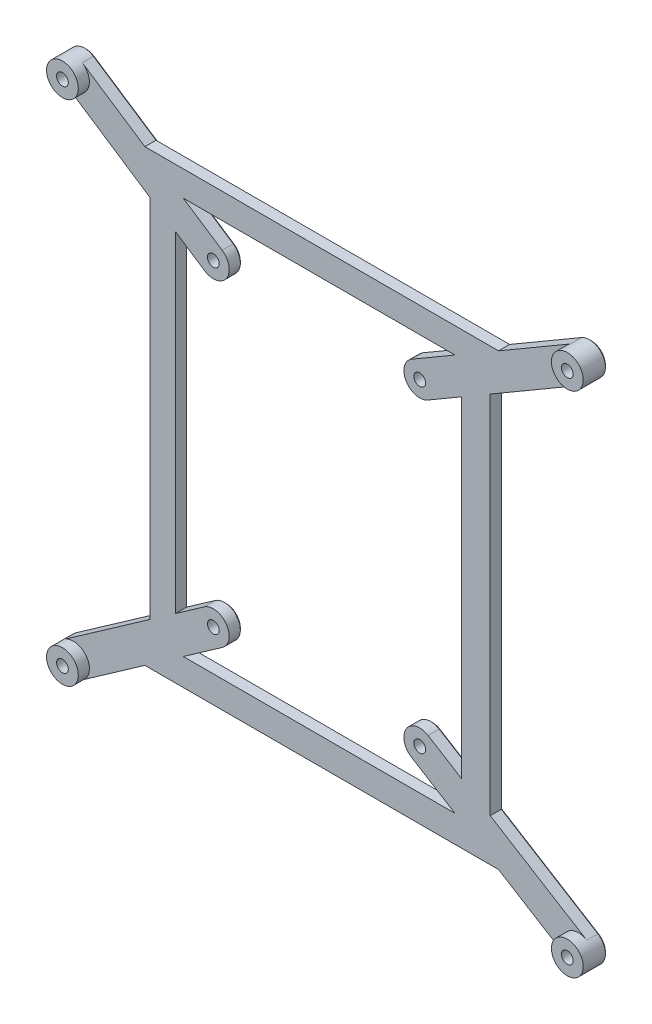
ISO-10303-21;
HEADER;
FILE_DESCRIPTION(('STEP AP214'),'2;1');
FILE_NAME('part.step','',(''),(''),'','','');
FILE_SCHEMA(('AUTOMOTIVE_DESIGN { 1 0 10303 214 1 1 1 1 }'));
ENDSEC;
DATA;
#1=APPLICATION_CONTEXT('core data for automotive mechanical design processes');
#2=APPLICATION_PROTOCOL_DEFINITION('international standard','automotive_design',2000,#1);
#3=PRODUCT_CONTEXT('',#1,'mechanical');
#4=PRODUCT('Part','Part','',(#3));
#5=PRODUCT_RELATED_PRODUCT_CATEGORY('part','',(#4));
#6=PRODUCT_DEFINITION_FORMATION('','',#4);
#7=PRODUCT_DEFINITION_CONTEXT('part definition',#1,'design');
#8=PRODUCT_DEFINITION('design','',#6,#7);
#9=PRODUCT_DEFINITION_SHAPE('','',#8);
#10=(LENGTH_UNIT() NAMED_UNIT(*) SI_UNIT(.MILLI.,.METRE.));
#11=(NAMED_UNIT(*) PLANE_ANGLE_UNIT() SI_UNIT($,.RADIAN.));
#12=(NAMED_UNIT(*) SI_UNIT($,.STERADIAN.) SOLID_ANGLE_UNIT());
#13=UNCERTAINTY_MEASURE_WITH_UNIT(LENGTH_MEASURE(1.E-05),#10,'distance_accuracy_value','');
#14=(GEOMETRIC_REPRESENTATION_CONTEXT(3) GLOBAL_UNCERTAINTY_ASSIGNED_CONTEXT((#13)) GLOBAL_UNIT_ASSIGNED_CONTEXT((#10,
#11,#12)) REPRESENTATION_CONTEXT('',''));
#15=CARTESIAN_POINT('',(0.,0.,0.));
#16=DIRECTION('',(0.,0.,1.));
#17=DIRECTION('',(1.,0.,0.));
#18=AXIS2_PLACEMENT_3D('',#15,#16,#17);
#19=CARTESIAN_POINT('',(-79.5,80.01,0.));
#20=DIRECTION('',(0.,0.,-1.));
#21=DIRECTION('',(-1.,0.,0.));
#22=AXIS2_PLACEMENT_3D('',#19,#20,#21);
#23=PLANE('',#22);
#24=CARTESIAN_POINT('',(-35.46999999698,50.87,0.));
#25=DIRECTION('',(0.,0.,1.));
#26=DIRECTION('',(-1.,0.,0.));
#27=AXIS2_PLACEMENT_3D('',#24,#25,#26);
#28=CIRCLE('',#27,1.85000000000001);
#29=CARTESIAN_POINT('',(-37.31999999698,50.87,0.));
#30=VERTEX_POINT('',#29);
#31=EDGE_CURVE('E413',#30,#30,#28,.T.);
#32=ORIENTED_EDGE('',*,*,#31,.F.);
#33=EDGE_LOOP('',(#32));
#34=FACE_BOUND('',#33,.T.);
#35=CARTESIAN_POINT('',(29.53000000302,50.87,0.));
#36=DIRECTION('',(0.,0.,1.));
#37=DIRECTION('',(-1.,0.,0.));
#38=AXIS2_PLACEMENT_3D('',#35,#36,#37);
#39=CIRCLE('',#38,1.85000000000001);
#40=CARTESIAN_POINT('',(27.68000000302,50.87,0.));
#41=VERTEX_POINT('',#40);
#42=EDGE_CURVE('E418',#41,#41,#39,.T.);
#43=ORIENTED_EDGE('',*,*,#42,.F.);
#44=EDGE_LOOP('',(#43));
#45=FACE_BOUND('',#44,.T.);
#46=CARTESIAN_POINT('',(29.53000000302,-49.13,0.));
#47=DIRECTION('',(0.,0.,1.));
#48=DIRECTION('',(1.,0.,0.));
#49=AXIS2_PLACEMENT_3D('',#46,#47,#48);
#50=CIRCLE('',#49,1.84999999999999);
#51=CARTESIAN_POINT('',(31.38000000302,-49.13,0.));
#52=VERTEX_POINT('',#51);
#53=EDGE_CURVE('E421',#52,#52,#50,.T.);
#54=ORIENTED_EDGE('',*,*,#53,.F.);
#55=EDGE_LOOP('',(#54));
#56=FACE_BOUND('',#55,.T.);
#57=CARTESIAN_POINT('',(-35.46999999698,-49.13,0.));
#58=DIRECTION('',(0.,0.,1.));
#59=DIRECTION('',(1.,0.,0.));
#60=AXIS2_PLACEMENT_3D('',#57,#58,#59);
#61=CIRCLE('',#60,1.85000000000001);
#62=CARTESIAN_POINT('',(-33.61999999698,-49.13,0.));
#63=VERTEX_POINT('',#62);
#64=EDGE_CURVE('E424',#63,#63,#61,.T.);
#65=ORIENTED_EDGE('',*,*,#64,.F.);
#66=EDGE_LOOP('',(#65));
#67=FACE_BOUND('',#66,.T.);
#68=DIRECTION('',(-0.818891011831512,-0.573949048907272,0.));
#69=VECTOR('',#68,1.);
#70=CARTESIAN_POINT('',(-44.9352270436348,-61.8698614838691,0.));
#71=LINE('',#70,#69);
#72=CARTESIAN_POINT('',(-32.6002547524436,-53.2244550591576,0.));
#73=VERTEX_POINT('',#72);
#74=CARTESIAN_POINT('',(-44.9352270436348,-61.8698614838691,0.));
#75=VERTEX_POINT('',#74);
#76=EDGE_CURVE('E430',#73,#75,#71,.T.);
#77=ORIENTED_EDGE('',*,*,#76,.F.);
#78=CARTESIAN_POINT('',(-35.46999999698,-49.13,0.));
#79=DIRECTION('',(0.,0.,-1.));
#80=DIRECTION('',(1.,0.,0.));
#81=AXIS2_PLACEMENT_3D('',#78,#79,#80);
#82=CIRCLE('',#81,5.00000000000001);
#83=CARTESIAN_POINT('',(-38.3397452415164,-45.0355449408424,0.));
#84=VERTEX_POINT('',#83);
#85=EDGE_CURVE('E427',#84,#73,#82,.T.);
#86=ORIENTED_EDGE('',*,*,#85,.F.);
#87=DIRECTION('',(0.818891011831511,0.573949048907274,0.));
#88=VECTOR('',#87,1.);
#89=CARTESIAN_POINT('',(-38.3397452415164,-45.0355449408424,0.));
#90=LINE('',#89,#88);
#91=CARTESIAN_POINT('',(-47.3470111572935,-51.3486093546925,0.));
#92=VERTEX_POINT('',#91);
#93=EDGE_CURVE('E472',#92,#84,#90,.T.);
#94=ORIENTED_EDGE('',*,*,#93,.F.);
#95=DIRECTION('',(0.,-1.,0.));
#96=VECTOR('',#95,1.);
#97=CARTESIAN_POINT('',(-47.3470111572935,52.7346132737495,0.));
#98=LINE('',#97,#96);
#99=CARTESIAN_POINT('',(-47.3470111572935,52.7346132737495,0.));
#100=VERTEX_POINT('',#99);
#101=EDGE_CURVE('E469',#100,#92,#98,.T.);
#102=ORIENTED_EDGE('',*,*,#101,.F.);
#103=DIRECTION('',(-0.833910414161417,0.551899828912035,0.));
#104=VECTOR('',#103,1.);
#105=CARTESIAN_POINT('',(-38.2294991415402,46.7004479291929,0.));
#106=LINE('',#105,#104);
#107=CARTESIAN_POINT('',(-38.2294991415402,46.7004479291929,0.));
#108=VERTEX_POINT('',#107);
#109=EDGE_CURVE('E466',#108,#100,#106,.T.);
#110=ORIENTED_EDGE('',*,*,#109,.F.);
#111=CARTESIAN_POINT('',(-35.46999999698,50.87,0.));
#112=DIRECTION('',(0.,0.,-1.));
#113=DIRECTION('',(-1.,0.,0.));
#114=AXIS2_PLACEMENT_3D('',#111,#112,#113);
#115=CIRCLE('',#114,5.);
#116=CARTESIAN_POINT('',(-32.7105008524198,55.0395520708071,0.));
#117=VERTEX_POINT('',#116);
#118=EDGE_CURVE('E463',#117,#108,#115,.T.);
#119=ORIENTED_EDGE('',*,*,#118,.F.);
#120=DIRECTION('',(0.833910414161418,-0.551899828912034,0.));
#121=VECTOR('',#120,1.);
#122=CARTESIAN_POINT('',(-44.935227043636,63.1301385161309,0.));
#123=LINE('',#122,#121);
#124=CARTESIAN_POINT('',(-44.935227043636,63.1301385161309,0.));
#125=VERTEX_POINT('',#124);
#126=EDGE_CURVE('E460',#125,#117,#123,.T.);
#127=ORIENTED_EDGE('',*,*,#126,.F.);
#128=DIRECTION('',(-1.,0.,0.));
#129=VECTOR('',#128,1.);
#130=CARTESIAN_POINT('',(40.6284884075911,63.1301385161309,0.));
#131=LINE('',#130,#129);
#132=CARTESIAN_POINT('',(40.6284884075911,63.1301385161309,0.));
#133=VERTEX_POINT('',#132);
#134=EDGE_CURVE('E457',#133,#125,#131,.T.);
#135=ORIENTED_EDGE('',*,*,#134,.F.);
#136=DIRECTION('',(0.863847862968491,0.503752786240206,0.));
#137=VECTOR('',#136,1.);
#138=CARTESIAN_POINT('',(27.011236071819,55.1892393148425,0.));
#139=LINE('',#138,#137);
#140=CARTESIAN_POINT('',(27.011236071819,55.1892393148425,0.));
#141=VERTEX_POINT('',#140);
#142=EDGE_CURVE('E454',#141,#133,#139,.T.);
#143=ORIENTED_EDGE('',*,*,#142,.F.);
#144=CARTESIAN_POINT('',(29.53000000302,50.87,0.));
#145=DIRECTION('',(0.,0.,-1.));
#146=DIRECTION('',(1.,0.,0.));
#147=AXIS2_PLACEMENT_3D('',#144,#145,#146);
#148=CIRCLE('',#147,5.00000000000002);
#149=CARTESIAN_POINT('',(32.0487639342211,46.5507606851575,0.));
#150=VERTEX_POINT('',#149);
#151=EDGE_CURVE('E451',#150,#141,#148,.T.);
#152=ORIENTED_EDGE('',*,*,#151,.F.);
#153=DIRECTION('',(-0.863847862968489,-0.503752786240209,0.));
#154=VECTOR('',#153,1.);
#155=CARTESIAN_POINT('',(42.6529888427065,52.7346132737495,0.));
#156=LINE('',#155,#154);
#157=CARTESIAN_POINT('',(42.6529888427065,52.7346132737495,0.));
#158=VERTEX_POINT('',#157);
#159=EDGE_CURVE('E448',#158,#150,#156,.T.);
#160=ORIENTED_EDGE('',*,*,#159,.F.);
#161=DIRECTION('',(0.,1.,0.));
#162=VECTOR('',#161,1.);
#163=CARTESIAN_POINT('',(42.6529888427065,-51.3486093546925,0.));
#164=LINE('',#163,#162);
#165=CARTESIAN_POINT('',(42.6529888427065,-51.3486093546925,0.));
#166=VERTEX_POINT('',#165);
#167=EDGE_CURVE('E445',#166,#158,#164,.T.);
#168=ORIENTED_EDGE('',*,*,#167,.F.);
#169=DIRECTION('',(0.85082710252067,-0.525445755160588,0.));
#170=VECTOR('',#169,1.);
#171=CARTESIAN_POINT('',(42.6529888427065,-51.3486093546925,0.));
#172=LINE('',#171,#170);
#173=CARTESIAN_POINT('',(32.16130929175,-44.8692571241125,0.));
#174=VERTEX_POINT('',#173);
#175=EDGE_CURVE('E442',#174,#166,#172,.T.);
#176=ORIENTED_EDGE('',*,*,#175,.F.);
#177=CARTESIAN_POINT('',(29.53000000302,-49.13,0.));
#178=DIRECTION('',(0.,0.,-1.));
#179=DIRECTION('',(-1.,0.,0.));
#180=AXIS2_PLACEMENT_3D('',#177,#178,#179);
#181=CIRCLE('',#180,5.00776581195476);
#182=CARTESIAN_POINT('',(26.8986907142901,-53.3907428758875,0.));
#183=VERTEX_POINT('',#182);
#184=EDGE_CURVE('E439',#183,#174,#181,.T.);
#185=ORIENTED_EDGE('',*,*,#184,.F.);
#186=DIRECTION('',(-0.850827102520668,0.525445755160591,0.));
#187=VECTOR('',#186,1.);
#188=CARTESIAN_POINT('',(26.8986907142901,-53.3907428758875,0.));
#189=LINE('',#188,#187);
#190=CARTESIAN_POINT('',(40.6284884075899,-61.8698614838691,0.));
#191=VERTEX_POINT('',#190);
#192=EDGE_CURVE('E436',#191,#183,#189,.T.);
#193=ORIENTED_EDGE('',*,*,#192,.F.);
#194=DIRECTION('',(1.,0.,0.));
#195=VECTOR('',#194,1.);
#196=CARTESIAN_POINT('',(40.6284884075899,-61.8698614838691,0.));
#197=LINE('',#196,#195);
#198=EDGE_CURVE('E433',#75,#191,#197,.T.);
#199=ORIENTED_EDGE('',*,*,#198,.F.);
#200=EDGE_LOOP('',(#77,#86,#94,#102,#110,#119,#127,#135,#143,#152,#160,#168,#176,#185,#193,#199));
#201=FACE_BOUND('',#200,.T.);
#202=CARTESIAN_POINT('',(-79.5,80.01,0.));
#203=DIRECTION('',(0.,0.,1.));
#204=DIRECTION('',(1.,0.,0.));
#205=AXIS2_PLACEMENT_3D('',#202,#203,#204);
#206=CIRCLE('',#205,4.99999999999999);
#207=CARTESIAN_POINT('',(-82.2594991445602,75.8404479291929,0.));
#208=VERTEX_POINT('',#207);
#209=CARTESIAN_POINT('',(-76.7405008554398,84.1795520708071,0.));
#210=VERTEX_POINT('',#209);
#211=EDGE_CURVE('E356',#208,#210,#206,.T.);
#212=ORIENTED_EDGE('',*,*,#211,.F.);
#213=DIRECTION('',(0.833910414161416,-0.551899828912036,0.));
#214=VECTOR('',#213,1.);
#215=CARTESIAN_POINT('',(-55.3470111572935,58.0291851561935,0.));
#216=LINE('',#215,#214);
#217=CARTESIAN_POINT('',(-55.3470111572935,58.0291851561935,0.));
#218=VERTEX_POINT('',#217);
#219=EDGE_CURVE('E365',#208,#218,#216,.T.);
#220=ORIENTED_EDGE('',*,*,#219,.T.);
#221=DIRECTION('',(0.,-1.,0.));
#222=VECTOR('',#221,1.);
#223=CARTESIAN_POINT('',(-55.3470111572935,58.0291851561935,0.));
#224=LINE('',#223,#222);
#225=CARTESIAN_POINT('',(-55.3470111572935,-56.9556954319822,0.));
#226=VERTEX_POINT('',#225);
#227=EDGE_CURVE('E372',#218,#226,#224,.T.);
#228=ORIENTED_EDGE('',*,*,#227,.T.);
#229=DIRECTION('',(-0.818891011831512,-0.573949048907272,0.));
#230=VECTOR('',#229,1.);
#231=CARTESIAN_POINT('',(-55.3470111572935,-56.9556954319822,0.));
#232=LINE('',#231,#230);
#233=CARTESIAN_POINT('',(-82.3697452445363,-75.8955449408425,0.));
#234=VERTEX_POINT('',#233);
#235=EDGE_CURVE('E507',#226,#234,#232,.T.);
#236=ORIENTED_EDGE('',*,*,#235,.T.);
#237=CARTESIAN_POINT('',(-79.5,-79.99,0.));
#238=DIRECTION('',(0.,0.,1.));
#239=DIRECTION('',(1.,0.,0.));
#240=AXIS2_PLACEMENT_3D('',#237,#238,#239);
#241=CIRCLE('',#240,5.00000000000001);
#242=CARTESIAN_POINT('',(-76.6302547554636,-84.0844550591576,0.));
#243=VERTEX_POINT('',#242);
#244=EDGE_CURVE('E409',#243,#234,#241,.T.);
#245=ORIENTED_EDGE('',*,*,#244,.F.);
#246=DIRECTION('',(0.818891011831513,0.57394904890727,0.));
#247=VECTOR('',#246,1.);
#248=CARTESIAN_POINT('',(-76.6302547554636,-84.0844550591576,0.));
#249=LINE('',#248,#247);
#250=CARTESIAN_POINT('',(-57.0230787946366,-70.3420646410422,0.));
#251=VERTEX_POINT('',#250);
#252=EDGE_CURVE('E510',#243,#251,#249,.T.);
#253=ORIENTED_EDGE('',*,*,#252,.T.);
#254=DIRECTION('',(1.,0.,0.));
#255=VECTOR('',#254,1.);
#256=CARTESIAN_POINT('',(-57.0230787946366,-70.3420646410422,0.));
#257=LINE('',#256,#255);
#258=CARTESIAN_POINT('',(54.3470882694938,-70.3420646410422,0.));
#259=VERTEX_POINT('',#258);
#260=EDGE_CURVE('E513',#251,#259,#257,.T.);
#261=ORIENTED_EDGE('',*,*,#260,.T.);
#262=DIRECTION('',(0.850827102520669,-0.525445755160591,0.));
#263=VECTOR('',#262,1.);
#264=CARTESIAN_POINT('',(54.3470882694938,-70.3420646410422,0.));
#265=LINE('',#264,#263);
#266=CARTESIAN_POINT('',(76.86869071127,-84.2507428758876,0.));
#267=VERTEX_POINT('',#266);
#268=EDGE_CURVE('E516',#259,#267,#265,.T.);
#269=ORIENTED_EDGE('',*,*,#268,.T.);
#270=CARTESIAN_POINT('',(79.5,-79.99,0.));
#271=DIRECTION('',(0.,0.,1.));
#272=DIRECTION('',(1.,0.,0.));
#273=AXIS2_PLACEMENT_3D('',#270,#271,#272);
#274=CIRCLE('',#273,5.00776581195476);
#275=CARTESIAN_POINT('',(82.13130928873,-75.7292571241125,0.));
#276=VERTEX_POINT('',#275);
#277=EDGE_CURVE('E398',#276,#267,#274,.T.);
#278=ORIENTED_EDGE('',*,*,#277,.F.);
#279=DIRECTION('',(-0.850827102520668,0.525445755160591,0.));
#280=VECTOR('',#279,1.);
#281=CARTESIAN_POINT('',(82.13130928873,-75.7292571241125,0.));
#282=LINE('',#281,#280);
#283=CARTESIAN_POINT('',(51.7322529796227,-56.9556954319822,0.));
#284=VERTEX_POINT('',#283);
#285=EDGE_CURVE('E519',#276,#284,#282,.T.);
#286=ORIENTED_EDGE('',*,*,#285,.T.);
#287=DIRECTION('',(0.,1.,0.));
#288=VECTOR('',#287,1.);
#289=CARTESIAN_POINT('',(51.7322529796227,58.0291851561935,0.));
#290=LINE('',#289,#288);
#291=CARTESIAN_POINT('',(51.7322529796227,58.0291851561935,0.));
#292=VERTEX_POINT('',#291);
#293=EDGE_CURVE('E522',#284,#292,#290,.T.);
#294=ORIENTED_EDGE('',*,*,#293,.T.);
#295=DIRECTION('',(0.863847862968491,0.503752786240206,0.));
#296=VECTOR('',#295,1.);
#297=CARTESIAN_POINT('',(82.0187639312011,75.6907606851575,0.));
#298=LINE('',#297,#296);
#299=CARTESIAN_POINT('',(82.0187639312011,75.6907606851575,0.));
#300=VERTEX_POINT('',#299);
#301=EDGE_CURVE('E525',#292,#300,#298,.T.);
#302=ORIENTED_EDGE('',*,*,#301,.T.);
#303=CARTESIAN_POINT('',(79.5,80.01,0.));
#304=DIRECTION('',(0.,0.,1.));
#305=DIRECTION('',(1.,0.,0.));
#306=AXIS2_PLACEMENT_3D('',#303,#304,#305);
#307=CIRCLE('',#306,5.00000000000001);
#308=CARTESIAN_POINT('',(76.981236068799,84.3292393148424,0.));
#309=VERTEX_POINT('',#308);
#310=EDGE_CURVE('E389',#309,#300,#307,.T.);
#311=ORIENTED_EDGE('',*,*,#310,.F.);
#312=DIRECTION('',(-0.86384786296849,-0.503752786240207,0.));
#313=VECTOR('',#312,1.);
#314=CARTESIAN_POINT('',(54.3470882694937,71.1301385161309,0.));
#315=LINE('',#314,#313);
#316=CARTESIAN_POINT('',(54.3470882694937,71.1301385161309,0.));
#317=VERTEX_POINT('',#316);
#318=EDGE_CURVE('E528',#309,#317,#315,.T.);
#319=ORIENTED_EDGE('',*,*,#318,.T.);
#320=DIRECTION('',(-1.,0.,0.));
#321=VECTOR('',#320,1.);
#322=CARTESIAN_POINT('',(-57.0230787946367,71.1301385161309,0.));
#323=LINE('',#322,#321);
#324=CARTESIAN_POINT('',(-57.0230787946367,71.1301385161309,0.));
#325=VERTEX_POINT('',#324);
#326=EDGE_CURVE('E531',#317,#325,#323,.T.);
#327=ORIENTED_EDGE('',*,*,#326,.T.);
#328=DIRECTION('',(-0.833910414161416,0.551899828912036,0.));
#329=VECTOR('',#328,1.);
#330=CARTESIAN_POINT('',(-76.7405008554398,84.1795520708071,0.));
#331=LINE('',#330,#329);
#332=EDGE_CURVE('E378',#325,#210,#331,.T.);
#333=ORIENTED_EDGE('',*,*,#332,.T.);
#334=EDGE_LOOP('',(#212,#220,#228,#236,#245,#253,#261,#269,#278,#286,#294,#302,#311,#319,#327,#333));
#335=FACE_BOUND('',#334,.T.);
#336=ADVANCED_FACE('F41',(#34,#45,#56,#67,#201,#335),#23,.F.);
#337=CARTESIAN_POINT('',(-55.3470111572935,58.0291851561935,-4.));
#338=DIRECTION('',(-0.551899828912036,-0.833910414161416,0.));
#339=DIRECTION('',(0.833910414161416,-0.551899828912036,0.));
#340=AXIS2_PLACEMENT_3D('',#337,#338,#339);
#341=PLANE('',#340);
#342=DIRECTION('',(0.,0.,1.));
#343=VECTOR('',#342,1.);
#344=CARTESIAN_POINT('',(-82.2594991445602,75.8404479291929,-4.));
#345=LINE('',#344,#343);
#346=CARTESIAN_POINT('',(-82.2594991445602,75.8404479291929,-3.5));
#347=VERTEX_POINT('',#346);
#348=EDGE_CURVE('E350',#347,#208,#345,.T.);
#349=ORIENTED_EDGE('',*,*,#348,.F.);
#350=DIRECTION('',(0.833910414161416,-0.551899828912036,0.));
#351=VECTOR('',#350,1.);
#352=CARTESIAN_POINT('',(-55.3470111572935,58.0291851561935,-3.5));
#353=LINE('',#352,#351);
#354=CARTESIAN_POINT('',(-55.3470111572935,58.0291851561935,-3.5));
#355=VERTEX_POINT('',#354);
#356=EDGE_CURVE('E681',#347,#355,#353,.T.);
#357=ORIENTED_EDGE('',*,*,#356,.T.);
#358=DIRECTION('',(0.,0.,1.));
#359=VECTOR('',#358,1.);
#360=CARTESIAN_POINT('',(-55.3470111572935,58.0291851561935,-4.));
#361=LINE('',#360,#359);
#362=EDGE_CURVE('E368',#355,#218,#361,.T.);
#363=ORIENTED_EDGE('',*,*,#362,.T.);
#364=ORIENTED_EDGE('',*,*,#219,.F.);
#365=EDGE_LOOP('',(#349,#357,#363,#364));
#366=FACE_BOUND('',#365,.T.);
#367=ADVANCED_FACE('F366',(#366),#341,.T.);
#368=CARTESIAN_POINT('',(-79.5,80.01,-4.));
#369=DIRECTION('',(0.,0.,1.));
#370=DIRECTION('',(1.,0.,0.));
#371=AXIS2_PLACEMENT_3D('',#368,#369,#370);
#372=CYLINDRICAL_SURFACE('',#371,5.00000000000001);
#373=DIRECTION('',(0.,0.,1.));
#374=VECTOR('',#373,1.);
#375=CARTESIAN_POINT('',(-76.7405008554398,84.1795520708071,-4.));
#376=LINE('',#375,#374);
#377=CARTESIAN_POINT('',(-76.7405008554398,84.1795520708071,-3.5));
#378=VERTEX_POINT('',#377);
#379=EDGE_CURVE('E362',#378,#210,#376,.T.);
#380=ORIENTED_EDGE('',*,*,#379,.F.);
#381=CARTESIAN_POINT('',(-79.5,80.01,-3.5));
#382=DIRECTION('',(0.,0.,-1.));
#383=DIRECTION('',(-1.,0.,0.));
#384=AXIS2_PLACEMENT_3D('',#381,#382,#383);
#385=CIRCLE('',#384,5.00000000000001);
#386=EDGE_CURVE('E358',#378,#347,#385,.F.);
#387=ORIENTED_EDGE('',*,*,#386,.T.);
#388=ORIENTED_EDGE('',*,*,#348,.T.);
#389=ORIENTED_EDGE('',*,*,#211,.T.);
#390=EDGE_LOOP('',(#380,#387,#388,#389));
#391=FACE_BOUND('',#390,.T.);
#392=CARTESIAN_POINT('',(-79.5,80.01,3.5));
#393=DIRECTION('',(0.,0.,1.));
#394=DIRECTION('',(1.,0.,0.));
#395=AXIS2_PLACEMENT_3D('',#392,#393,#394);
#396=CIRCLE('',#395,4.99999999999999);
#397=CARTESIAN_POINT('',(-74.5,80.01,3.5));
#398=VERTEX_POINT('',#397);
#399=EDGE_CURVE('E380',#398,#398,#396,.T.);
#400=ORIENTED_EDGE('',*,*,#399,.F.);
#401=EDGE_LOOP('',(#400));
#402=FACE_BOUND('',#401,.T.);
#403=ADVANCED_FACE('F353',(#391,#402),#372,.T.);
#404=CARTESIAN_POINT('',(-76.7405008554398,84.1795520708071,-4.));
#405=DIRECTION('',(0.551899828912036,0.833910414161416,0.));
#406=DIRECTION('',(-0.833910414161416,0.551899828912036,0.));
#407=AXIS2_PLACEMENT_3D('',#404,#405,#406);
#408=PLANE('',#407);
#409=DIRECTION('',(0.,0.,1.));
#410=VECTOR('',#409,1.);
#411=CARTESIAN_POINT('',(-57.0230787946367,71.1301385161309,-4.));
#412=LINE('',#411,#410);
#413=CARTESIAN_POINT('',(-57.0230787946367,71.1301385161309,-3.5));
#414=VERTEX_POINT('',#413);
#415=EDGE_CURVE('E535',#414,#325,#412,.T.);
#416=ORIENTED_EDGE('',*,*,#415,.F.);
#417=DIRECTION('',(-0.833910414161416,0.551899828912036,0.));
#418=VECTOR('',#417,1.);
#419=CARTESIAN_POINT('',(-76.7405008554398,84.1795520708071,-3.5));
#420=LINE('',#419,#418);
#421=EDGE_CURVE('E678',#414,#378,#420,.T.);
#422=ORIENTED_EDGE('',*,*,#421,.T.);
#423=ORIENTED_EDGE('',*,*,#379,.T.);
#424=ORIENTED_EDGE('',*,*,#332,.F.);
#425=EDGE_LOOP('',(#416,#422,#423,#424));
#426=FACE_BOUND('',#425,.T.);
#427=ADVANCED_FACE('F951',(#426),#408,.T.);
#428=CARTESIAN_POINT('',(-57.0230787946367,71.1301385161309,-4.));
#429=DIRECTION('',(0.,1.,0.));
#430=DIRECTION('',(0.,0.,1.));
#431=AXIS2_PLACEMENT_3D('',#428,#429,#430);
#432=PLANE('',#431);
#433=DIRECTION('',(0.,0.,1.));
#434=VECTOR('',#433,1.);
#435=CARTESIAN_POINT('',(54.3470882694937,71.1301385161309,-4.));
#436=LINE('',#435,#434);
#437=CARTESIAN_POINT('',(54.3470882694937,71.1301385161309,-3.5));
#438=VERTEX_POINT('',#437);
#439=EDGE_CURVE('E537',#438,#317,#436,.T.);
#440=ORIENTED_EDGE('',*,*,#439,.F.);
#441=DIRECTION('',(-1.,0.,0.));
#442=VECTOR('',#441,1.);
#443=CARTESIAN_POINT('',(-57.0230787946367,71.1301385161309,-3.5));
#444=LINE('',#443,#442);
#445=EDGE_CURVE('E676',#438,#414,#444,.T.);
#446=ORIENTED_EDGE('',*,*,#445,.T.);
#447=ORIENTED_EDGE('',*,*,#415,.T.);
#448=ORIENTED_EDGE('',*,*,#326,.F.);
#449=EDGE_LOOP('',(#440,#446,#447,#448));
#450=FACE_BOUND('',#449,.T.);
#451=ADVANCED_FACE('F954',(#450),#432,.T.);
#452=CARTESIAN_POINT('',(54.3470882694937,71.1301385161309,-4.));
#453=DIRECTION('',(-0.503752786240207,0.86384786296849,0.));
#454=DIRECTION('',(-0.86384786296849,-0.503752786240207,0.));
#455=AXIS2_PLACEMENT_3D('',#452,#453,#454);
#456=PLANE('',#455);
#457=DIRECTION('',(0.,0.,1.));
#458=VECTOR('',#457,1.);
#459=CARTESIAN_POINT('',(76.981236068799,84.3292393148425,-4.));
#460=LINE('',#459,#458);
#461=CARTESIAN_POINT('',(76.981236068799,84.3292393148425,-3.5));
#462=VERTEX_POINT('',#461);
#463=EDGE_CURVE('E539',#462,#309,#460,.T.);
#464=ORIENTED_EDGE('',*,*,#463,.F.);
#465=DIRECTION('',(-0.86384786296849,-0.503752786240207,0.));
#466=VECTOR('',#465,1.);
#467=CARTESIAN_POINT('',(54.3470882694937,71.1301385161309,-3.5));
#468=LINE('',#467,#466);
#469=EDGE_CURVE('E674',#462,#438,#468,.T.);
#470=ORIENTED_EDGE('',*,*,#469,.T.);
#471=ORIENTED_EDGE('',*,*,#439,.T.);
#472=ORIENTED_EDGE('',*,*,#318,.F.);
#473=EDGE_LOOP('',(#464,#470,#471,#472));
#474=FACE_BOUND('',#473,.T.);
#475=ADVANCED_FACE('F958',(#474),#456,.T.);
#476=CARTESIAN_POINT('',(79.5,80.01,-4.));
#477=DIRECTION('',(0.,0.,1.));
#478=DIRECTION('',(1.,0.,0.));
#479=AXIS2_PLACEMENT_3D('',#476,#477,#478);
#480=CYLINDRICAL_SURFACE('',#479,5.00000000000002);
#481=DIRECTION('',(0.,0.,1.));
#482=VECTOR('',#481,1.);
#483=CARTESIAN_POINT('',(82.0187639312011,75.6907606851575,-4.));
#484=LINE('',#483,#482);
#485=CARTESIAN_POINT('',(82.0187639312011,75.6907606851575,-3.5));
#486=VERTEX_POINT('',#485);
#487=EDGE_CURVE('E541',#486,#300,#484,.T.);
#488=ORIENTED_EDGE('',*,*,#487,.F.);
#489=CARTESIAN_POINT('',(79.5,80.01,-3.5));
#490=DIRECTION('',(0.,0.,-1.));
#491=DIRECTION('',(-1.,0.,0.));
#492=AXIS2_PLACEMENT_3D('',#489,#490,#491);
#493=CIRCLE('',#492,5.00000000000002);
#494=EDGE_CURVE('E672',#486,#462,#493,.F.);
#495=ORIENTED_EDGE('',*,*,#494,.T.);
#496=ORIENTED_EDGE('',*,*,#463,.T.);
#497=ORIENTED_EDGE('',*,*,#310,.T.);
#498=EDGE_LOOP('',(#488,#495,#496,#497));
#499=FACE_BOUND('',#498,.T.);
#500=CARTESIAN_POINT('',(79.5,80.01,3.5));
#501=DIRECTION('',(0.,0.,1.));
#502=DIRECTION('',(1.,0.,0.));
#503=AXIS2_PLACEMENT_3D('',#500,#501,#502);
#504=CIRCLE('',#503,5.00000000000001);
#505=CARTESIAN_POINT('',(84.5,80.01,3.5));
#506=VERTEX_POINT('',#505);
#507=EDGE_CURVE('E383',#506,#506,#504,.T.);
#508=ORIENTED_EDGE('',*,*,#507,.F.);
#509=EDGE_LOOP('',(#508));
#510=FACE_BOUND('',#509,.T.);
#511=ADVANCED_FACE('F962',(#499,#510),#480,.T.);
#512=CARTESIAN_POINT('',(82.0187639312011,75.6907606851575,-4.));
#513=DIRECTION('',(0.503752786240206,-0.863847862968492,0.));
#514=DIRECTION('',(0.863847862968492,0.503752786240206,0.));
#515=AXIS2_PLACEMENT_3D('',#512,#513,#514);
#516=PLANE('',#515);
#517=DIRECTION('',(0.,0.,1.));
#518=VECTOR('',#517,1.);
#519=CARTESIAN_POINT('',(51.7322529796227,58.0291851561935,-4.));
#520=LINE('',#519,#518);
#521=CARTESIAN_POINT('',(51.7322529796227,58.0291851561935,-3.5));
#522=VERTEX_POINT('',#521);
#523=EDGE_CURVE('E543',#522,#292,#520,.T.);
#524=ORIENTED_EDGE('',*,*,#523,.F.);
#525=DIRECTION('',(0.863847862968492,0.503752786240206,0.));
#526=VECTOR('',#525,1.);
#527=CARTESIAN_POINT('',(82.0187639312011,75.6907606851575,-3.5));
#528=LINE('',#527,#526);
#529=EDGE_CURVE('E670',#522,#486,#528,.T.);
#530=ORIENTED_EDGE('',*,*,#529,.T.);
#531=ORIENTED_EDGE('',*,*,#487,.T.);
#532=ORIENTED_EDGE('',*,*,#301,.F.);
#533=EDGE_LOOP('',(#524,#530,#531,#532));
#534=FACE_BOUND('',#533,.T.);
#535=ADVANCED_FACE('F966',(#534),#516,.T.);
#536=CARTESIAN_POINT('',(51.7322529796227,58.0291851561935,-4.));
#537=DIRECTION('',(1.,0.,0.));
#538=DIRECTION('',(0.,1.,0.));
#539=AXIS2_PLACEMENT_3D('',#536,#537,#538);
#540=PLANE('',#539);
#541=DIRECTION('',(0.,0.,1.));
#542=VECTOR('',#541,1.);
#543=CARTESIAN_POINT('',(51.7322529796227,-56.9556954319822,-4.));
#544=LINE('',#543,#542);
#545=CARTESIAN_POINT('',(51.7322529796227,-56.9556954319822,-3.5));
#546=VERTEX_POINT('',#545);
#547=EDGE_CURVE('E545',#546,#284,#544,.T.);
#548=ORIENTED_EDGE('',*,*,#547,.F.);
#549=DIRECTION('',(0.,1.,0.));
#550=VECTOR('',#549,1.);
#551=CARTESIAN_POINT('',(51.7322529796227,58.0291851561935,-3.5));
#552=LINE('',#551,#550);
#553=EDGE_CURVE('E668',#546,#522,#552,.T.);
#554=ORIENTED_EDGE('',*,*,#553,.T.);
#555=ORIENTED_EDGE('',*,*,#523,.T.);
#556=ORIENTED_EDGE('',*,*,#293,.F.);
#557=EDGE_LOOP('',(#548,#554,#555,#556));
#558=FACE_BOUND('',#557,.T.);
#559=ADVANCED_FACE('F970',(#558),#540,.T.);
#560=CARTESIAN_POINT('',(82.13130928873,-75.7292571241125,-4.));
#561=DIRECTION('',(0.525445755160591,0.850827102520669,0.));
#562=DIRECTION('',(-0.850827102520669,0.525445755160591,0.));
#563=AXIS2_PLACEMENT_3D('',#560,#561,#562);
#564=PLANE('',#563);
#565=DIRECTION('',(0.,0.,1.));
#566=VECTOR('',#565,1.);
#567=CARTESIAN_POINT('',(82.13130928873,-75.7292571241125,-4.));
#568=LINE('',#567,#566);
#569=CARTESIAN_POINT('',(82.13130928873,-75.7292571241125,-3.5));
#570=VERTEX_POINT('',#569);
#571=EDGE_CURVE('E547',#570,#276,#568,.T.);
#572=ORIENTED_EDGE('',*,*,#571,.F.);
#573=DIRECTION('',(-0.850827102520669,0.525445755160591,0.));
#574=VECTOR('',#573,1.);
#575=CARTESIAN_POINT('',(82.13130928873,-75.7292571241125,-3.5));
#576=LINE('',#575,#574);
#577=EDGE_CURVE('E666',#570,#546,#576,.T.);
#578=ORIENTED_EDGE('',*,*,#577,.T.);
#579=ORIENTED_EDGE('',*,*,#547,.T.);
#580=ORIENTED_EDGE('',*,*,#285,.F.);
#581=EDGE_LOOP('',(#572,#578,#579,#580));
#582=FACE_BOUND('',#581,.T.);
#583=ADVANCED_FACE('F974',(#582),#564,.T.);
#584=CARTESIAN_POINT('',(79.5,-79.99,-4.));
#585=DIRECTION('',(0.,0.,1.));
#586=DIRECTION('',(1.,0.,0.));
#587=AXIS2_PLACEMENT_3D('',#584,#585,#586);
#588=CYLINDRICAL_SURFACE('',#587,5.00776581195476);
#589=DIRECTION('',(0.,0.,1.));
#590=VECTOR('',#589,1.);
#591=CARTESIAN_POINT('',(76.86869071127,-84.2507428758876,-4.));
#592=LINE('',#591,#590);
#593=CARTESIAN_POINT('',(76.86869071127,-84.2507428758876,-3.5));
#594=VERTEX_POINT('',#593);
#595=EDGE_CURVE('E549',#594,#267,#592,.T.);
#596=ORIENTED_EDGE('',*,*,#595,.F.);
#597=CARTESIAN_POINT('',(79.5,-79.99,-3.5));
#598=DIRECTION('',(0.,0.,-1.));
#599=DIRECTION('',(-1.,0.,0.));
#600=AXIS2_PLACEMENT_3D('',#597,#598,#599);
#601=CIRCLE('',#600,5.00776581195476);
#602=EDGE_CURVE('E664',#594,#570,#601,.F.);
#603=ORIENTED_EDGE('',*,*,#602,.T.);
#604=ORIENTED_EDGE('',*,*,#571,.T.);
#605=ORIENTED_EDGE('',*,*,#277,.T.);
#606=EDGE_LOOP('',(#596,#603,#604,#605));
#607=FACE_BOUND('',#606,.T.);
#608=CARTESIAN_POINT('',(79.5,-79.99,3.5));
#609=DIRECTION('',(0.,0.,1.));
#610=DIRECTION('',(1.,0.,0.));
#611=AXIS2_PLACEMENT_3D('',#608,#609,#610);
#612=CIRCLE('',#611,5.00776581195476);
#613=CARTESIAN_POINT('',(84.5077658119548,-79.99,3.5));
#614=VERTEX_POINT('',#613);
#615=EDGE_CURVE('E397',#614,#614,#612,.T.);
#616=ORIENTED_EDGE('',*,*,#615,.F.);
#617=EDGE_LOOP('',(#616));
#618=FACE_BOUND('',#617,.T.);
#619=ADVANCED_FACE('F978',(#607,#618),#588,.T.);
#620=CARTESIAN_POINT('',(54.3470882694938,-70.3420646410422,-4.));
#621=DIRECTION('',(-0.525445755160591,-0.850827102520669,0.));
#622=DIRECTION('',(0.850827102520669,-0.525445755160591,0.));
#623=AXIS2_PLACEMENT_3D('',#620,#621,#622);
#624=PLANE('',#623);
#625=DIRECTION('',(0.,0.,1.));
#626=VECTOR('',#625,1.);
#627=CARTESIAN_POINT('',(54.3470882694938,-70.3420646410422,-4.));
#628=LINE('',#627,#626);
#629=CARTESIAN_POINT('',(54.3470882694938,-70.3420646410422,-3.5));
#630=VERTEX_POINT('',#629);
#631=EDGE_CURVE('E551',#630,#259,#628,.T.);
#632=ORIENTED_EDGE('',*,*,#631,.F.);
#633=DIRECTION('',(0.850827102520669,-0.525445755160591,0.));
#634=VECTOR('',#633,1.);
#635=CARTESIAN_POINT('',(54.3470882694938,-70.3420646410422,-3.5));
#636=LINE('',#635,#634);
#637=EDGE_CURVE('E662',#630,#594,#636,.T.);
#638=ORIENTED_EDGE('',*,*,#637,.T.);
#639=ORIENTED_EDGE('',*,*,#595,.T.);
#640=ORIENTED_EDGE('',*,*,#268,.F.);
#641=EDGE_LOOP('',(#632,#638,#639,#640));
#642=FACE_BOUND('',#641,.T.);
#643=ADVANCED_FACE('F982',(#642),#624,.T.);
#644=CARTESIAN_POINT('',(-57.0230787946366,-70.3420646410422,-4.));
#645=DIRECTION('',(0.,-1.,0.));
#646=DIRECTION('',(0.,0.,-1.));
#647=AXIS2_PLACEMENT_3D('',#644,#645,#646);
#648=PLANE('',#647);
#649=DIRECTION('',(0.,0.,1.));
#650=VECTOR('',#649,1.);
#651=CARTESIAN_POINT('',(-57.0230787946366,-70.3420646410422,-4.));
#652=LINE('',#651,#650);
#653=CARTESIAN_POINT('',(-57.0230787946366,-70.3420646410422,-3.5));
#654=VERTEX_POINT('',#653);
#655=EDGE_CURVE('E553',#654,#251,#652,.T.);
#656=ORIENTED_EDGE('',*,*,#655,.F.);
#657=DIRECTION('',(1.,0.,0.));
#658=VECTOR('',#657,1.);
#659=CARTESIAN_POINT('',(-57.0230787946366,-70.3420646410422,-3.5));
#660=LINE('',#659,#658);
#661=EDGE_CURVE('E660',#654,#630,#660,.T.);
#662=ORIENTED_EDGE('',*,*,#661,.T.);
#663=ORIENTED_EDGE('',*,*,#631,.T.);
#664=ORIENTED_EDGE('',*,*,#260,.F.);
#665=EDGE_LOOP('',(#656,#662,#663,#664));
#666=FACE_BOUND('',#665,.T.);
#667=ADVANCED_FACE('F986',(#666),#648,.T.);
#668=CARTESIAN_POINT('',(-76.6302547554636,-84.0844550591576,-4.));
#669=DIRECTION('',(0.57394904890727,-0.818891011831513,0.));
#670=DIRECTION('',(0.818891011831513,0.57394904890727,0.));
#671=AXIS2_PLACEMENT_3D('',#668,#669,#670);
#672=PLANE('',#671);
#673=DIRECTION('',(0.,0.,1.));
#674=VECTOR('',#673,1.);
#675=CARTESIAN_POINT('',(-76.6302547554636,-84.0844550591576,-4.));
#676=LINE('',#675,#674);
#677=CARTESIAN_POINT('',(-76.6302547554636,-84.0844550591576,-3.5));
#678=VERTEX_POINT('',#677);
#679=EDGE_CURVE('E555',#678,#243,#676,.T.);
#680=ORIENTED_EDGE('',*,*,#679,.F.);
#681=DIRECTION('',(0.818891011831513,0.57394904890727,0.));
#682=VECTOR('',#681,1.);
#683=CARTESIAN_POINT('',(-76.6302547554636,-84.0844550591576,-3.5));
#684=LINE('',#683,#682);
#685=EDGE_CURVE('E658',#678,#654,#684,.T.);
#686=ORIENTED_EDGE('',*,*,#685,.T.);
#687=ORIENTED_EDGE('',*,*,#655,.T.);
#688=ORIENTED_EDGE('',*,*,#252,.F.);
#689=EDGE_LOOP('',(#680,#686,#687,#688));
#690=FACE_BOUND('',#689,.T.);
#691=ADVANCED_FACE('F990',(#690),#672,.T.);
#692=CARTESIAN_POINT('',(-79.5,-79.99,-4.));
#693=DIRECTION('',(0.,0.,1.));
#694=DIRECTION('',(1.,0.,0.));
#695=AXIS2_PLACEMENT_3D('',#692,#693,#694);
#696=CYLINDRICAL_SURFACE('',#695,5.);
#697=DIRECTION('',(0.,0.,1.));
#698=VECTOR('',#697,1.);
#699=CARTESIAN_POINT('',(-82.3697452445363,-75.8955449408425,-4.));
#700=LINE('',#699,#698);
#701=CARTESIAN_POINT('',(-82.3697452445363,-75.8955449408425,-3.5));
#702=VERTEX_POINT('',#701);
#703=EDGE_CURVE('E557',#702,#234,#700,.T.);
#704=ORIENTED_EDGE('',*,*,#703,.F.);
#705=CARTESIAN_POINT('',(-79.5,-79.99,-3.5));
#706=DIRECTION('',(0.,0.,-1.));
#707=DIRECTION('',(-1.,0.,0.));
#708=AXIS2_PLACEMENT_3D('',#705,#706,#707);
#709=CIRCLE('',#708,5.);
#710=EDGE_CURVE('E656',#702,#678,#709,.F.);
#711=ORIENTED_EDGE('',*,*,#710,.T.);
#712=ORIENTED_EDGE('',*,*,#679,.T.);
#713=ORIENTED_EDGE('',*,*,#244,.T.);
#714=EDGE_LOOP('',(#704,#711,#712,#713));
#715=FACE_BOUND('',#714,.T.);
#716=CARTESIAN_POINT('',(-79.5,-79.99,3.5));
#717=DIRECTION('',(0.,0.,1.));
#718=DIRECTION('',(1.,0.,0.));
#719=AXIS2_PLACEMENT_3D('',#716,#717,#718);
#720=CIRCLE('',#719,5.00000000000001);
#721=CARTESIAN_POINT('',(-74.5,-79.99,3.5));
#722=VERTEX_POINT('',#721);
#723=EDGE_CURVE('E410',#722,#722,#720,.T.);
#724=ORIENTED_EDGE('',*,*,#723,.F.);
#725=EDGE_LOOP('',(#724));
#726=FACE_BOUND('',#725,.T.);
#727=ADVANCED_FACE('F994',(#715,#726),#696,.T.);
#728=CARTESIAN_POINT('',(-55.3470111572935,-56.9556954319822,-4.));
#729=DIRECTION('',(-0.573949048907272,0.818891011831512,0.));
#730=DIRECTION('',(-0.818891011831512,-0.573949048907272,0.));
#731=AXIS2_PLACEMENT_3D('',#728,#729,#730);
#732=PLANE('',#731);
#733=DIRECTION('',(0.,0.,1.));
#734=VECTOR('',#733,1.);
#735=CARTESIAN_POINT('',(-55.3470111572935,-56.9556954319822,-4.));
#736=LINE('',#735,#734);
#737=CARTESIAN_POINT('',(-55.3470111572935,-56.9556954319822,-3.5));
#738=VERTEX_POINT('',#737);
#739=EDGE_CURVE('E559',#738,#226,#736,.T.);
#740=ORIENTED_EDGE('',*,*,#739,.F.);
#741=DIRECTION('',(-0.818891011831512,-0.573949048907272,0.));
#742=VECTOR('',#741,1.);
#743=CARTESIAN_POINT('',(-55.3470111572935,-56.9556954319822,-3.5));
#744=LINE('',#743,#742);
#745=EDGE_CURVE('E654',#738,#702,#744,.T.);
#746=ORIENTED_EDGE('',*,*,#745,.T.);
#747=ORIENTED_EDGE('',*,*,#703,.T.);
#748=ORIENTED_EDGE('',*,*,#235,.F.);
#749=EDGE_LOOP('',(#740,#746,#747,#748));
#750=FACE_BOUND('',#749,.T.);
#751=ADVANCED_FACE('F998',(#750),#732,.T.);
#752=CARTESIAN_POINT('',(-55.3470111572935,58.0291851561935,-4.));
#753=DIRECTION('',(-1.,0.,0.));
#754=DIRECTION('',(0.,-1.,0.));
#755=AXIS2_PLACEMENT_3D('',#752,#753,#754);
#756=PLANE('',#755);
#757=ORIENTED_EDGE('',*,*,#362,.F.);
#758=DIRECTION('',(0.,-1.,0.));
#759=VECTOR('',#758,1.);
#760=CARTESIAN_POINT('',(-55.3470111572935,58.0291851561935,-3.5));
#761=LINE('',#760,#759);
#762=EDGE_CURVE('E361',#355,#738,#761,.T.);
#763=ORIENTED_EDGE('',*,*,#762,.T.);
#764=ORIENTED_EDGE('',*,*,#739,.T.);
#765=ORIENTED_EDGE('',*,*,#227,.F.);
#766=EDGE_LOOP('',(#757,#763,#764,#765));
#767=FACE_BOUND('',#766,.T.);
#768=ADVANCED_FACE('F1002',(#767),#756,.T.);
#769=CARTESIAN_POINT('',(-79.5,80.01,-4.));
#770=DIRECTION('',(0.,0.,-1.));
#771=DIRECTION('',(-1.,0.,0.));
#772=AXIS2_PLACEMENT_3D('',#769,#770,#771);
#773=PLANE('',#772);
#774=DIRECTION('',(0.818891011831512,0.573949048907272,0.));
#775=VECTOR('',#774,1.);
#776=CARTESIAN_POINT('',(-6.88249593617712,-23.5981887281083,-4.));
#777=LINE('',#776,#775);
#778=CARTESIAN_POINT('',(-82.0827707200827,-76.3049904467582,-4.));
#779=VERTEX_POINT('',#778);
#780=CARTESIAN_POINT('',(-54.8470111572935,-57.2158344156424,-4.));
#781=VERTEX_POINT('',#780);
#782=EDGE_CURVE('E649',#779,#781,#777,.T.);
#783=ORIENTED_EDGE('',*,*,#782,.T.);
#784=DIRECTION('',(0.,1.,0.));
#785=VECTOR('',#784,1.);
#786=CARTESIAN_POINT('',(-54.8470111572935,80.01,-4.));
#787=LINE('',#786,#785);
#788=CARTESIAN_POINT('',(-54.8470111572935,58.2978592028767,-4.));
#789=VERTEX_POINT('',#788);
#790=EDGE_CURVE('E651',#781,#789,#787,.T.);
#791=ORIENTED_EDGE('',*,*,#790,.T.);
#792=DIRECTION('',(-0.833910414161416,0.551899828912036,0.));
#793=VECTOR('',#792,1.);
#794=CARTESIAN_POINT('',(-81.9835492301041,76.2574031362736,-4.));
#795=LINE('',#794,#793);
#796=CARTESIAN_POINT('',(-81.9835492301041,76.2574031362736,-4.));
#797=VERTEX_POINT('',#796);
#798=EDGE_CURVE('E621',#789,#797,#795,.T.);
#799=ORIENTED_EDGE('',*,*,#798,.T.);
#800=CARTESIAN_POINT('',(-79.5,80.01,-4.));
#801=DIRECTION('',(0.,0.,-1.));
#802=DIRECTION('',(-1.,0.,0.));
#803=AXIS2_PLACEMENT_3D('',#800,#801,#802);
#804=CIRCLE('',#803,4.5);
#805=CARTESIAN_POINT('',(-77.0164507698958,83.7625968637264,-4.));
#806=VERTEX_POINT('',#805);
#807=EDGE_CURVE('E623',#797,#806,#804,.T.);
#808=ORIENTED_EDGE('',*,*,#807,.T.);
#809=DIRECTION('',(0.833910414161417,-0.551899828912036,0.));
#810=VECTOR('',#809,1.);
#811=CARTESIAN_POINT('',(-77.0164507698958,83.7625968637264,-4.));
#812=LINE('',#811,#810);
#813=CARTESIAN_POINT('',(-57.1735495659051,70.6301385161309,-4.));
#814=VERTEX_POINT('',#813);
#815=EDGE_CURVE('E625',#806,#814,#812,.T.);
#816=ORIENTED_EDGE('',*,*,#815,.T.);
#817=DIRECTION('',(1.,0.,0.));
#818=VECTOR('',#817,1.);
#819=CARTESIAN_POINT('',(-79.5,70.6301385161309,-4.));
#820=LINE('',#819,#818);
#821=CARTESIAN_POINT('',(54.4822261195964,70.6301385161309,-4.));
#822=VERTEX_POINT('',#821);
#823=EDGE_CURVE('E627',#814,#822,#820,.T.);
#824=ORIENTED_EDGE('',*,*,#823,.T.);
#825=DIRECTION('',(0.86384786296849,0.503752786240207,0.));
#826=VECTOR('',#825,1.);
#827=CARTESIAN_POINT('',(-41.4179552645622,14.7059582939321,-4.));
#828=LINE('',#827,#826);
#829=CARTESIAN_POINT('',(77.233112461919,83.8973153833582,-4.));
#830=VERTEX_POINT('',#829);
#831=EDGE_CURVE('E629',#822,#830,#828,.T.);
#832=ORIENTED_EDGE('',*,*,#831,.T.);
#833=CARTESIAN_POINT('',(79.5,80.01,-4.));
#834=DIRECTION('',(0.,0.,-1.));
#835=DIRECTION('',(-1.,0.,0.));
#836=AXIS2_PLACEMENT_3D('',#833,#834,#835);
#837=CIRCLE('',#836,4.50000000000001);
#838=CARTESIAN_POINT('',(81.766887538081,76.1226846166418,-4.));
#839=VERTEX_POINT('',#838);
#840=EDGE_CURVE('E631',#830,#839,#837,.T.);
#841=ORIENTED_EDGE('',*,*,#840,.T.);
#842=DIRECTION('',(-0.863847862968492,-0.503752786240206,0.));
#843=VECTOR('',#842,1.);
#844=CARTESIAN_POINT('',(-36.8841801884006,6.93132752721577,-4.));
#845=LINE('',#844,#843);
#846=CARTESIAN_POINT('',(51.2322529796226,58.316415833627,-4.));
#847=VERTEX_POINT('',#846);
#848=EDGE_CURVE('E633',#839,#847,#845,.T.);
#849=ORIENTED_EDGE('',*,*,#848,.T.);
#850=DIRECTION('',(0.,-1.,0.));
#851=VECTOR('',#850,1.);
#852=CARTESIAN_POINT('',(51.2322529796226,80.01,-4.));
#853=LINE('',#852,#851);
#854=CARTESIAN_POINT('',(51.2322529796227,-57.2345736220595,-4.));
#855=VERTEX_POINT('',#854);
#856=EDGE_CURVE('E635',#847,#855,#853,.T.);
#857=ORIENTED_EDGE('',*,*,#856,.T.);
#858=DIRECTION('',(0.850827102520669,-0.525445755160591,0.));
#859=VECTOR('',#858,1.);
#860=CARTESIAN_POINT('',(-104.762746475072,39.1033427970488,-4.));
#861=LINE('',#860,#859);
#862=CARTESIAN_POINT('',(81.8685864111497,-76.1546706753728,-4.));
#863=VERTEX_POINT('',#862);
#864=EDGE_CURVE('E637',#855,#863,#861,.T.);
#865=ORIENTED_EDGE('',*,*,#864,.T.);
#866=CARTESIAN_POINT('',(79.5,-79.99,-4.));
#867=DIRECTION('',(0.,0.,-1.));
#868=DIRECTION('',(-1.,0.,0.));
#869=AXIS2_PLACEMENT_3D('',#866,#867,#868);
#870=CIRCLE('',#869,4.50776581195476);
#871=CARTESIAN_POINT('',(77.1314135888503,-83.8253293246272,-4.));
#872=VERTEX_POINT('',#871);
#873=EDGE_CURVE('E639',#863,#872,#870,.T.);
#874=ORIENTED_EDGE('',*,*,#873,.T.);
#875=DIRECTION('',(-0.850827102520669,0.525445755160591,0.));
#876=VECTOR('',#875,1.);
#877=CARTESIAN_POINT('',(-109.499919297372,31.4326841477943,-4.));
#878=LINE('',#877,#876);
#879=CARTESIAN_POINT('',(54.4890371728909,-69.8420646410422,-4.));
#880=VERTEX_POINT('',#879);
#881=EDGE_CURVE('E641',#872,#880,#878,.T.);
#882=ORIENTED_EDGE('',*,*,#881,.T.);
#883=DIRECTION('',(-1.,0.,0.));
#884=VECTOR('',#883,1.);
#885=CARTESIAN_POINT('',(-79.5,-69.8420646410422,-4.));
#886=LINE('',#885,#884);
#887=CARTESIAN_POINT('',(-57.1808532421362,-69.8420646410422,-4.));
#888=VERTEX_POINT('',#887);
#889=EDGE_CURVE('E643',#880,#888,#886,.T.);
#890=ORIENTED_EDGE('',*,*,#889,.T.);
#891=DIRECTION('',(-0.818891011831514,-0.57394904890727,0.));
#892=VECTOR('',#891,1.);
#893=CARTESIAN_POINT('',(-1.71695449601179,-30.9682078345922,-4.));
#894=LINE('',#893,#892);
#895=CARTESIAN_POINT('',(-76.9172292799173,-83.6750095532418,-4.));
#896=VERTEX_POINT('',#895);
#897=EDGE_CURVE('E645',#888,#896,#894,.T.);
#898=ORIENTED_EDGE('',*,*,#897,.T.);
#899=CARTESIAN_POINT('',(-79.5,-79.99,-4.));
#900=DIRECTION('',(0.,0.,-1.));
#901=DIRECTION('',(-1.,0.,0.));
#902=AXIS2_PLACEMENT_3D('',#899,#900,#901);
#903=CIRCLE('',#902,4.49999999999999);
#904=EDGE_CURVE('E647',#896,#779,#903,.T.);
#905=ORIENTED_EDGE('',*,*,#904,.T.);
#906=EDGE_LOOP('',(#783,#791,#799,#808,#816,#824,#832,#841,#849,#857,#865,#874,#882,#890,#898,#905));
#907=FACE_BOUND('',#906,.T.);
#908=DIRECTION('',(0.,-1.,0.));
#909=VECTOR('',#908,1.);
#910=CARTESIAN_POINT('',(-47.8470111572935,-51.3486093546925,-4.));
#911=LINE('',#910,#909);
#912=CARTESIAN_POINT('',(-47.8470111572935,53.6651088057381,-4.));
#913=VERTEX_POINT('',#912);
#914=CARTESIAN_POINT('',(-47.8470111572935,-52.3096340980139,-4.));
#915=VERTEX_POINT('',#914);
#916=EDGE_CURVE('E616',#913,#915,#911,.T.);
#917=ORIENTED_EDGE('',*,*,#916,.T.);
#918=DIRECTION('',(0.818891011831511,0.573949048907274,0.));
#919=VECTOR('',#918,1.);
#920=CARTESIAN_POINT('',(-38.0527707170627,-45.4449904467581,-4.));
#921=LINE('',#920,#919);
#922=CARTESIAN_POINT('',(-38.0527707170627,-45.4449904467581,-4.));
#923=VERTEX_POINT('',#922);
#924=EDGE_CURVE('E618',#915,#923,#921,.T.);
#925=ORIENTED_EDGE('',*,*,#924,.T.);
#926=CARTESIAN_POINT('',(-35.46999999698,-49.13,-4.));
#927=DIRECTION('',(0.,0.,-1.));
#928=DIRECTION('',(-1.,0.,0.));
#929=AXIS2_PLACEMENT_3D('',#926,#927,#928);
#930=CIRCLE('',#929,4.50000000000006);
#931=CARTESIAN_POINT('',(-32.8872292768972,-52.8150095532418,-4.));
#932=VERTEX_POINT('',#931);
#933=EDGE_CURVE('E588',#923,#932,#930,.T.);
#934=ORIENTED_EDGE('',*,*,#933,.T.);
#935=DIRECTION('',(-0.818891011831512,-0.573949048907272,0.));
#936=VECTOR('',#935,1.);
#937=CARTESIAN_POINT('',(-45.2222015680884,-61.4604159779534,-4.));
#938=LINE('',#937,#936);
#939=CARTESIAN_POINT('',(-46.5197675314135,-62.3698614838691,-4.));
#940=VERTEX_POINT('',#939);
#941=EDGE_CURVE('E590',#932,#940,#938,.T.);
#942=ORIENTED_EDGE('',*,*,#941,.T.);
#943=DIRECTION('',(1.,0.,0.));
#944=VECTOR('',#943,1.);
#945=CARTESIAN_POINT('',(40.6284884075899,-62.3698614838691,-4.));
#946=LINE('',#945,#944);
#947=CARTESIAN_POINT('',(42.3896855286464,-62.3698614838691,-4.));
#948=VERTEX_POINT('',#947);
#949=EDGE_CURVE('E592',#940,#948,#946,.T.);
#950=ORIENTED_EDGE('',*,*,#949,.T.);
#951=DIRECTION('',(-0.850827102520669,0.525445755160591,0.));
#952=VECTOR('',#951,1.);
#953=CARTESIAN_POINT('',(27.1614135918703,-52.9653293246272,-4.));
#954=LINE('',#953,#952);
#955=CARTESIAN_POINT('',(27.1614135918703,-52.9653293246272,-4.));
#956=VERTEX_POINT('',#955);
#957=EDGE_CURVE('E594',#948,#956,#954,.T.);
#958=ORIENTED_EDGE('',*,*,#957,.T.);
#959=CARTESIAN_POINT('',(29.53000000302,-49.13,-4.));
#960=DIRECTION('',(0.,0.,-1.));
#961=DIRECTION('',(-1.,0.,0.));
#962=AXIS2_PLACEMENT_3D('',#959,#960,#961);
#963=CIRCLE('',#962,4.50776581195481);
#964=CARTESIAN_POINT('',(31.8985864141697,-45.2946706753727,-4.));
#965=VERTEX_POINT('',#964);
#966=EDGE_CURVE('E596',#956,#965,#963,.T.);
#967=ORIENTED_EDGE('',*,*,#966,.T.);
#968=DIRECTION('',(0.85082710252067,-0.525445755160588,0.));
#969=VECTOR('',#968,1.);
#970=CARTESIAN_POINT('',(42.3902659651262,-51.7740229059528,-4.));
#971=LINE('',#970,#969);
#972=CARTESIAN_POINT('',(43.1529888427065,-52.2450580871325,-4.));
#973=VERTEX_POINT('',#972);
#974=EDGE_CURVE('E598',#965,#973,#971,.T.);
#975=ORIENTED_EDGE('',*,*,#974,.T.);
#976=DIRECTION('',(0.,1.,0.));
#977=VECTOR('',#976,1.);
#978=CARTESIAN_POINT('',(43.1529888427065,52.7346132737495,-4.));
#979=LINE('',#978,#977);
#980=CARTESIAN_POINT('',(43.1529888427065,53.6049938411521,-4.));
#981=VERTEX_POINT('',#980);
#982=EDGE_CURVE('E600',#973,#981,#979,.T.);
#983=ORIENTED_EDGE('',*,*,#982,.T.);
#984=DIRECTION('',(-0.863847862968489,-0.503752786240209,0.));
#985=VECTOR('',#984,1.);
#986=CARTESIAN_POINT('',(31.796887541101,46.9826846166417,-4.));
#987=LINE('',#986,#985);
#988=CARTESIAN_POINT('',(31.796887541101,46.9826846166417,-4.));
#989=VERTEX_POINT('',#988);
#990=EDGE_CURVE('E602',#981,#989,#987,.T.);
#991=ORIENTED_EDGE('',*,*,#990,.T.);
#992=CARTESIAN_POINT('',(29.53000000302,50.87,-4.));
#993=DIRECTION('',(0.,0.,-1.));
#994=DIRECTION('',(-1.,0.,0.));
#995=AXIS2_PLACEMENT_3D('',#992,#993,#994);
#996=CIRCLE('',#995,4.50000000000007);
#997=CARTESIAN_POINT('',(27.263112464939,54.7573153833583,-4.));
#998=VERTEX_POINT('',#997);
#999=EDGE_CURVE('E604',#989,#998,#996,.T.);
#1000=ORIENTED_EDGE('',*,*,#999,.T.);
#1001=DIRECTION('',(0.863847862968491,0.503752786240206,0.));
#1002=VECTOR('',#1001,1.);
#1003=CARTESIAN_POINT('',(40.8803648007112,62.6982145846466,-4.));
#1004=LINE('',#1003,#1002);
#1005=CARTESIAN_POINT('',(42.4784512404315,63.6301385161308,-4.));
#1006=VERTEX_POINT('',#1005);
#1007=EDGE_CURVE('E606',#998,#1006,#1004,.T.);
#1008=ORIENTED_EDGE('',*,*,#1007,.T.);
#1009=DIRECTION('',(-1.,0.,0.));
#1010=VECTOR('',#1009,1.);
#1011=CARTESIAN_POINT('',(-44.935227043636,63.6301385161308,-4.));
#1012=LINE('',#1011,#1010);
#1013=CARTESIAN_POINT('',(-46.5966792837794,63.6301385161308,-4.));
#1014=VERTEX_POINT('',#1013);
#1015=EDGE_CURVE('E608',#1006,#1014,#1012,.T.);
#1016=ORIENTED_EDGE('',*,*,#1015,.T.);
#1017=DIRECTION('',(0.833910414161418,-0.551899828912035,0.));
#1018=VECTOR('',#1017,1.);
#1019=CARTESIAN_POINT('',(-32.9864507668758,54.6225968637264,-4.));
#1020=LINE('',#1019,#1018);
#1021=CARTESIAN_POINT('',(-32.9864507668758,54.6225968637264,-4.));
#1022=VERTEX_POINT('',#1021);
#1023=EDGE_CURVE('E610',#1014,#1022,#1020,.T.);
#1024=ORIENTED_EDGE('',*,*,#1023,.T.);
#1025=CARTESIAN_POINT('',(-35.46999999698,50.87,-4.));
#1026=DIRECTION('',(0.,0.,-1.));
#1027=DIRECTION('',(-1.,0.,0.));
#1028=AXIS2_PLACEMENT_3D('',#1025,#1026,#1027);
#1029=CIRCLE('',#1028,4.50000000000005);
#1030=CARTESIAN_POINT('',(-37.9535492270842,47.1174031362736,-4.));
#1031=VERTEX_POINT('',#1030);
#1032=EDGE_CURVE('E612',#1022,#1031,#1029,.T.);
#1033=ORIENTED_EDGE('',*,*,#1032,.T.);
#1034=DIRECTION('',(-0.833910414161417,0.551899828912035,0.));
#1035=VECTOR('',#1034,1.);
#1036=CARTESIAN_POINT('',(-47.0710612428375,53.1515684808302,-4.));
#1037=LINE('',#1036,#1035);
#1038=EDGE_CURVE('E614',#1031,#913,#1037,.T.);
#1039=ORIENTED_EDGE('',*,*,#1038,.T.);
#1040=EDGE_LOOP('',(#917,#925,#934,#942,#950,#958,#967,#975,#983,#991,#1000,#1008,#1016,#1024,
#1033,#1039));
#1041=FACE_BOUND('',#1040,.T.);
#1042=CARTESIAN_POINT('',(-35.46999999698,-49.13,-4.));
#1043=DIRECTION('',(0.,0.,-1.));
#1044=DIRECTION('',(-1.,0.,0.));
#1045=AXIS2_PLACEMENT_3D('',#1042,#1043,#1044);
#1046=CIRCLE('',#1045,2.34999999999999);
#1047=CARTESIAN_POINT('',(-37.81999999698,-49.13,-4.));
#1048=VERTEX_POINT('',#1047);
#1049=EDGE_CURVE('E585',#1048,#1048,#1046,.F.);
#1050=ORIENTED_EDGE('',*,*,#1049,.T.);
#1051=EDGE_LOOP('',(#1050));
#1052=FACE_BOUND('',#1051,.T.);
#1053=CARTESIAN_POINT('',(29.53000000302,-49.13,-4.));
#1054=DIRECTION('',(0.,0.,-1.));
#1055=DIRECTION('',(-1.,0.,0.));
#1056=AXIS2_PLACEMENT_3D('',#1053,#1054,#1055);
#1057=CIRCLE('',#1056,2.34999999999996);
#1058=CARTESIAN_POINT('',(27.18000000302,-49.13,-4.));
#1059=VERTEX_POINT('',#1058);
#1060=EDGE_CURVE('E582',#1059,#1059,#1057,.F.);
#1061=ORIENTED_EDGE('',*,*,#1060,.T.);
#1062=EDGE_LOOP('',(#1061));
#1063=FACE_BOUND('',#1062,.T.);
#1064=CARTESIAN_POINT('',(79.5,80.01,-4.));
#1065=DIRECTION('',(0.,0.,-1.));
#1066=DIRECTION('',(-1.,0.,0.));
#1067=AXIS2_PLACEMENT_3D('',#1064,#1065,#1066);
#1068=CIRCLE('',#1067,2.35000000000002);
#1069=CARTESIAN_POINT('',(77.15,80.01,-4.));
#1070=VERTEX_POINT('',#1069);
#1071=EDGE_CURVE('E579',#1070,#1070,#1068,.F.);
#1072=ORIENTED_EDGE('',*,*,#1071,.T.);
#1073=EDGE_LOOP('',(#1072));
#1074=FACE_BOUND('',#1073,.T.);
#1075=CARTESIAN_POINT('',(79.5,-79.99,-4.));
#1076=DIRECTION('',(0.,0.,-1.));
#1077=DIRECTION('',(-1.,0.,0.));
#1078=AXIS2_PLACEMENT_3D('',#1075,#1076,#1077);
#1079=CIRCLE('',#1078,2.35000000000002);
#1080=CARTESIAN_POINT('',(77.15,-79.99,-4.));
#1081=VERTEX_POINT('',#1080);
#1082=EDGE_CURVE('E576',#1081,#1081,#1079,.F.);
#1083=ORIENTED_EDGE('',*,*,#1082,.T.);
#1084=EDGE_LOOP('',(#1083));
#1085=FACE_BOUND('',#1084,.T.);
#1086=CARTESIAN_POINT('',(-79.5,-79.99,-4.));
#1087=DIRECTION('',(0.,0.,-1.));
#1088=DIRECTION('',(-1.,0.,0.));
#1089=AXIS2_PLACEMENT_3D('',#1086,#1087,#1088);
#1090=CIRCLE('',#1089,2.35000000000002);
#1091=CARTESIAN_POINT('',(-81.85,-79.99,-4.));
#1092=VERTEX_POINT('',#1091);
#1093=EDGE_CURVE('E573',#1092,#1092,#1090,.F.);
#1094=ORIENTED_EDGE('',*,*,#1093,.T.);
#1095=EDGE_LOOP('',(#1094));
#1096=FACE_BOUND('',#1095,.T.);
#1097=CARTESIAN_POINT('',(29.53000000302,50.87,-4.));
#1098=DIRECTION('',(0.,0.,-1.));
#1099=DIRECTION('',(-1.,0.,0.));
#1100=AXIS2_PLACEMENT_3D('',#1097,#1098,#1099);
#1101=CIRCLE('',#1100,2.35000000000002);
#1102=CARTESIAN_POINT('',(27.18000000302,50.87,-4.));
#1103=VERTEX_POINT('',#1102);
#1104=EDGE_CURVE('E570',#1103,#1103,#1101,.F.);
#1105=ORIENTED_EDGE('',*,*,#1104,.T.);
#1106=EDGE_LOOP('',(#1105));
#1107=FACE_BOUND('',#1106,.T.);
#1108=CARTESIAN_POINT('',(-35.46999999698,50.87,-4.));
#1109=DIRECTION('',(0.,0.,-1.));
#1110=DIRECTION('',(-1.,0.,0.));
#1111=AXIS2_PLACEMENT_3D('',#1108,#1109,#1110);
#1112=CIRCLE('',#1111,2.35000000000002);
#1113=CARTESIAN_POINT('',(-37.81999999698,50.87,-4.));
#1114=VERTEX_POINT('',#1113);
#1115=EDGE_CURVE('E567',#1114,#1114,#1112,.F.);
#1116=ORIENTED_EDGE('',*,*,#1115,.T.);
#1117=EDGE_LOOP('',(#1116));
#1118=FACE_BOUND('',#1117,.T.);
#1119=CARTESIAN_POINT('',(-79.5,80.01,-4.));
#1120=DIRECTION('',(0.,0.,-1.));
#1121=DIRECTION('',(-1.,0.,0.));
#1122=AXIS2_PLACEMENT_3D('',#1119,#1120,#1121);
#1123=CIRCLE('',#1122,2.35000000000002);
#1124=CARTESIAN_POINT('',(-81.85,80.01,-4.));
#1125=VERTEX_POINT('',#1124);
#1126=EDGE_CURVE('E564',#1125,#1125,#1123,.F.);
#1127=ORIENTED_EDGE('',*,*,#1126,.T.);
#1128=EDGE_LOOP('',(#1127));
#1129=FACE_BOUND('',#1128,.T.);
#1130=ADVANCED_FACE('F868',(#907,#1041,#1052,#1063,#1074,#1085,#1096,#1107,#1118,#1129),#773,.T.);
#1131=CARTESIAN_POINT('',(-35.46999999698,-49.13,-4.));
#1132=DIRECTION('',(0.,0.,1.));
#1133=DIRECTION('',(1.,0.,0.));
#1134=AXIS2_PLACEMENT_3D('',#1131,#1132,#1133);
#1135=CYLINDRICAL_SURFACE('',#1134,5.00000000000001);
#1136=DIRECTION('',(0.,0.,1.));
#1137=VECTOR('',#1136,1.);
#1138=CARTESIAN_POINT('',(-32.6002547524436,-53.2244550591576,-4.));
#1139=LINE('',#1138,#1137);
#1140=CARTESIAN_POINT('',(-32.6002547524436,-53.2244550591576,-3.50000000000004));
#1141=VERTEX_POINT('',#1140);
#1142=EDGE_CURVE('E475',#1141,#73,#1139,.T.);
#1143=ORIENTED_EDGE('',*,*,#1142,.F.);
#1144=CARTESIAN_POINT('',(-35.46999999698,-49.13,-3.50000000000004));
#1145=DIRECTION('',(0.,0.,-1.));
#1146=DIRECTION('',(-1.,0.,0.));
#1147=AXIS2_PLACEMENT_3D('',#1144,#1145,#1146);
#1148=CIRCLE('',#1147,5.00000000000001);
#1149=CARTESIAN_POINT('',(-38.3397452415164,-45.0355449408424,-3.50000000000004));
#1150=VERTEX_POINT('',#1149);
#1151=EDGE_CURVE('E712',#1141,#1150,#1148,.F.);
#1152=ORIENTED_EDGE('',*,*,#1151,.T.);
#1153=DIRECTION('',(0.,0.,1.));
#1154=VECTOR('',#1153,1.);
#1155=CARTESIAN_POINT('',(-38.3397452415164,-45.0355449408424,-4.));
#1156=LINE('',#1155,#1154);
#1157=EDGE_CURVE('E373',#1150,#84,#1156,.T.);
#1158=ORIENTED_EDGE('',*,*,#1157,.T.);
#1159=ORIENTED_EDGE('',*,*,#85,.T.);
#1160=EDGE_LOOP('',(#1143,#1152,#1158,#1159));
#1161=FACE_BOUND('',#1160,.T.);
#1162=ADVANCED_FACE('F900',(#1161),#1135,.T.);
#1163=CARTESIAN_POINT('',(-38.3397452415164,-45.0355449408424,-4.));
#1164=DIRECTION('',(0.573949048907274,-0.818891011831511,0.));
#1165=DIRECTION('',(0.818891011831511,0.573949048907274,0.));
#1166=AXIS2_PLACEMENT_3D('',#1163,#1164,#1165);
#1167=PLANE('',#1166);
#1168=ORIENTED_EDGE('',*,*,#1157,.F.);
#1169=DIRECTION('',(-0.818891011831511,-0.573949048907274,0.));
#1170=VECTOR('',#1169,1.);
#1171=CARTESIAN_POINT('',(-47.3470111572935,-51.3486093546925,-3.50000000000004));
#1172=LINE('',#1171,#1170);
#1173=CARTESIAN_POINT('',(-47.3470111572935,-51.3486093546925,-3.50000000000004));
#1174=VERTEX_POINT('',#1173);
#1175=EDGE_CURVE('E683',#1150,#1174,#1172,.T.);
#1176=ORIENTED_EDGE('',*,*,#1175,.T.);
#1177=DIRECTION('',(0.,0.,1.));
#1178=VECTOR('',#1177,1.);
#1179=CARTESIAN_POINT('',(-47.3470111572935,-51.3486093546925,-4.));
#1180=LINE('',#1179,#1178);
#1181=EDGE_CURVE('E477',#1174,#92,#1180,.T.);
#1182=ORIENTED_EDGE('',*,*,#1181,.T.);
#1183=ORIENTED_EDGE('',*,*,#93,.T.);
#1184=EDGE_LOOP('',(#1168,#1176,#1182,#1183));
#1185=FACE_BOUND('',#1184,.T.);
#1186=ADVANCED_FACE('F906',(#1185),#1167,.F.);
#1187=CARTESIAN_POINT('',(-47.3470111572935,52.7346132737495,-4.));
#1188=DIRECTION('',(-1.,0.,0.));
#1189=DIRECTION('',(0.,0.,1.));
#1190=AXIS2_PLACEMENT_3D('',#1187,#1188,#1189);
#1191=PLANE('',#1190);
#1192=ORIENTED_EDGE('',*,*,#1181,.F.);
#1193=DIRECTION('',(0.,1.,0.));
#1194=VECTOR('',#1193,1.);
#1195=CARTESIAN_POINT('',(-47.3470111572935,52.7346132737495,-3.50000000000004));
#1196=LINE('',#1195,#1194);
#1197=CARTESIAN_POINT('',(-47.3470111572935,52.7346132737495,-3.50000000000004));
#1198=VERTEX_POINT('',#1197);
#1199=EDGE_CURVE('E686',#1174,#1198,#1196,.T.);
#1200=ORIENTED_EDGE('',*,*,#1199,.T.);
#1201=DIRECTION('',(0.,0.,1.));
#1202=VECTOR('',#1201,1.);
#1203=CARTESIAN_POINT('',(-47.3470111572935,52.7346132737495,-4.));
#1204=LINE('',#1203,#1202);
#1205=EDGE_CURVE('E479',#1198,#100,#1204,.T.);
#1206=ORIENTED_EDGE('',*,*,#1205,.T.);
#1207=ORIENTED_EDGE('',*,*,#101,.T.);
#1208=EDGE_LOOP('',(#1192,#1200,#1206,#1207));
#1209=FACE_BOUND('',#1208,.T.);
#1210=ADVANCED_FACE('F909',(#1209),#1191,.F.);
#1211=CARTESIAN_POINT('',(-38.2294991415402,46.7004479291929,-4.));
#1212=DIRECTION('',(0.551899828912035,0.833910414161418,0.));
#1213=DIRECTION('',(-0.833910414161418,0.551899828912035,0.));
#1214=AXIS2_PLACEMENT_3D('',#1211,#1212,#1213);
#1215=PLANE('',#1214);
#1216=ORIENTED_EDGE('',*,*,#1205,.F.);
#1217=DIRECTION('',(0.833910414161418,-0.551899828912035,0.));
#1218=VECTOR('',#1217,1.);
#1219=CARTESIAN_POINT('',(-38.2294991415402,46.7004479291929,-3.50000000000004));
#1220=LINE('',#1219,#1218);
#1221=CARTESIAN_POINT('',(-38.2294991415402,46.7004479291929,-3.50000000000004));
#1222=VERTEX_POINT('',#1221);
#1223=EDGE_CURVE('E688',#1198,#1222,#1220,.T.);
#1224=ORIENTED_EDGE('',*,*,#1223,.T.);
#1225=DIRECTION('',(0.,0.,1.));
#1226=VECTOR('',#1225,1.);
#1227=CARTESIAN_POINT('',(-38.2294991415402,46.7004479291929,-4.));
#1228=LINE('',#1227,#1226);
#1229=EDGE_CURVE('E481',#1222,#108,#1228,.T.);
#1230=ORIENTED_EDGE('',*,*,#1229,.T.);
#1231=ORIENTED_EDGE('',*,*,#109,.T.);
#1232=EDGE_LOOP('',(#1216,#1224,#1230,#1231));
#1233=FACE_BOUND('',#1232,.T.);
#1234=ADVANCED_FACE('F915',(#1233),#1215,.F.);
#1235=CARTESIAN_POINT('',(-35.46999999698,50.87,-4.));
#1236=DIRECTION('',(0.,0.,1.));
#1237=DIRECTION('',(1.,0.,0.));
#1238=AXIS2_PLACEMENT_3D('',#1235,#1236,#1237);
#1239=CYLINDRICAL_SURFACE('',#1238,5.);
#1240=ORIENTED_EDGE('',*,*,#1229,.F.);
#1241=CARTESIAN_POINT('',(-35.46999999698,50.87,-3.50000000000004));
#1242=DIRECTION('',(0.,0.,-1.));
#1243=DIRECTION('',(-1.,0.,0.));
#1244=AXIS2_PLACEMENT_3D('',#1241,#1242,#1243);
#1245=CIRCLE('',#1244,5.);
#1246=CARTESIAN_POINT('',(-32.7105008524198,55.0395520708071,-3.50000000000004));
#1247=VERTEX_POINT('',#1246);
#1248=EDGE_CURVE('E690',#1222,#1247,#1245,.F.);
#1249=ORIENTED_EDGE('',*,*,#1248,.T.);
#1250=DIRECTION('',(0.,0.,1.));
#1251=VECTOR('',#1250,1.);
#1252=CARTESIAN_POINT('',(-32.7105008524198,55.0395520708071,-4.));
#1253=LINE('',#1252,#1251);
#1254=EDGE_CURVE('E483',#1247,#117,#1253,.T.);
#1255=ORIENTED_EDGE('',*,*,#1254,.T.);
#1256=ORIENTED_EDGE('',*,*,#118,.T.);
#1257=EDGE_LOOP('',(#1240,#1249,#1255,#1256));
#1258=FACE_BOUND('',#1257,.T.);
#1259=ADVANCED_FACE('F920',(#1258),#1239,.T.);
#1260=CARTESIAN_POINT('',(-44.935227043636,63.1301385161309,-4.));
#1261=DIRECTION('',(-0.551899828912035,-0.833910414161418,0.));
#1262=DIRECTION('',(0.833910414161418,-0.551899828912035,0.));
#1263=AXIS2_PLACEMENT_3D('',#1260,#1261,#1262);
#1264=PLANE('',#1263);
#1265=ORIENTED_EDGE('',*,*,#1254,.F.);
#1266=DIRECTION('',(-0.833910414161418,0.551899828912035,0.));
#1267=VECTOR('',#1266,1.);
#1268=CARTESIAN_POINT('',(-44.935227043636,63.1301385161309,-3.50000000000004));
#1269=LINE('',#1268,#1267);
#1270=CARTESIAN_POINT('',(-44.935227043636,63.1301385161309,-3.50000000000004));
#1271=VERTEX_POINT('',#1270);
#1272=EDGE_CURVE('E692',#1247,#1271,#1269,.T.);
#1273=ORIENTED_EDGE('',*,*,#1272,.T.);
#1274=DIRECTION('',(0.,0.,1.));
#1275=VECTOR('',#1274,1.);
#1276=CARTESIAN_POINT('',(-44.935227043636,63.1301385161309,-4.));
#1277=LINE('',#1276,#1275);
#1278=EDGE_CURVE('E485',#1271,#125,#1277,.T.);
#1279=ORIENTED_EDGE('',*,*,#1278,.T.);
#1280=ORIENTED_EDGE('',*,*,#126,.T.);
#1281=EDGE_LOOP('',(#1265,#1273,#1279,#1280));
#1282=FACE_BOUND('',#1281,.T.);
#1283=ADVANCED_FACE('F924',(#1282),#1264,.F.);
#1284=CARTESIAN_POINT('',(40.6284884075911,63.1301385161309,-4.));
#1285=DIRECTION('',(0.,1.,0.));
#1286=DIRECTION('',(0.,0.,1.));
#1287=AXIS2_PLACEMENT_3D('',#1284,#1285,#1286);
#1288=PLANE('',#1287);
#1289=ORIENTED_EDGE('',*,*,#1278,.F.);
#1290=DIRECTION('',(1.,0.,0.));
#1291=VECTOR('',#1290,1.);
#1292=CARTESIAN_POINT('',(40.6284884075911,63.1301385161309,-3.50000000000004));
#1293=LINE('',#1292,#1291);
#1294=CARTESIAN_POINT('',(40.6284884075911,63.1301385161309,-3.50000000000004));
#1295=VERTEX_POINT('',#1294);
#1296=EDGE_CURVE('E694',#1271,#1295,#1293,.T.);
#1297=ORIENTED_EDGE('',*,*,#1296,.T.);
#1298=DIRECTION('',(0.,0.,1.));
#1299=VECTOR('',#1298,1.);
#1300=CARTESIAN_POINT('',(40.6284884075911,63.1301385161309,-4.));
#1301=LINE('',#1300,#1299);
#1302=EDGE_CURVE('E487',#1295,#133,#1301,.T.);
#1303=ORIENTED_EDGE('',*,*,#1302,.T.);
#1304=ORIENTED_EDGE('',*,*,#134,.T.);
#1305=EDGE_LOOP('',(#1289,#1297,#1303,#1304));
#1306=FACE_BOUND('',#1305,.T.);
#1307=ADVANCED_FACE('F927',(#1306),#1288,.F.);
#1308=CARTESIAN_POINT('',(27.011236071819,55.1892393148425,-4.));
#1309=DIRECTION('',(0.503752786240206,-0.863847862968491,0.));
#1310=DIRECTION('',(0.863847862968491,0.503752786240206,0.));
#1311=AXIS2_PLACEMENT_3D('',#1308,#1309,#1310);
#1312=PLANE('',#1311);
#1313=ORIENTED_EDGE('',*,*,#1302,.F.);
#1314=DIRECTION('',(-0.863847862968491,-0.503752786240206,0.));
#1315=VECTOR('',#1314,1.);
#1316=CARTESIAN_POINT('',(27.011236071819,55.1892393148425,-3.50000000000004));
#1317=LINE('',#1316,#1315);
#1318=CARTESIAN_POINT('',(27.011236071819,55.1892393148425,-3.50000000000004));
#1319=VERTEX_POINT('',#1318);
#1320=EDGE_CURVE('E696',#1295,#1319,#1317,.T.);
#1321=ORIENTED_EDGE('',*,*,#1320,.T.);
#1322=DIRECTION('',(0.,0.,1.));
#1323=VECTOR('',#1322,1.);
#1324=CARTESIAN_POINT('',(27.011236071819,55.1892393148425,-4.));
#1325=LINE('',#1324,#1323);
#1326=EDGE_CURVE('E489',#1319,#141,#1325,.T.);
#1327=ORIENTED_EDGE('',*,*,#1326,.T.);
#1328=ORIENTED_EDGE('',*,*,#142,.T.);
#1329=EDGE_LOOP('',(#1313,#1321,#1327,#1328));
#1330=FACE_BOUND('',#1329,.T.);
#1331=ADVANCED_FACE('F855',(#1330),#1312,.F.);
#1332=CARTESIAN_POINT('',(29.53000000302,50.87,-4.));
#1333=DIRECTION('',(0.,0.,1.));
#1334=DIRECTION('',(1.,0.,0.));
#1335=AXIS2_PLACEMENT_3D('',#1332,#1333,#1334);
#1336=CYLINDRICAL_SURFACE('',#1335,5.00000000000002);
#1337=ORIENTED_EDGE('',*,*,#1326,.F.);
#1338=CARTESIAN_POINT('',(29.53000000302,50.87,-3.50000000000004));
#1339=DIRECTION('',(0.,0.,-1.));
#1340=DIRECTION('',(-1.,0.,0.));
#1341=AXIS2_PLACEMENT_3D('',#1338,#1339,#1340);
#1342=CIRCLE('',#1341,5.00000000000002);
#1343=CARTESIAN_POINT('',(32.0487639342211,46.5507606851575,-3.50000000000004));
#1344=VERTEX_POINT('',#1343);
#1345=EDGE_CURVE('E698',#1319,#1344,#1342,.F.);
#1346=ORIENTED_EDGE('',*,*,#1345,.T.);
#1347=DIRECTION('',(0.,0.,1.));
#1348=VECTOR('',#1347,1.);
#1349=CARTESIAN_POINT('',(32.0487639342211,46.5507606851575,-4.));
#1350=LINE('',#1349,#1348);
#1351=EDGE_CURVE('E491',#1344,#150,#1350,.T.);
#1352=ORIENTED_EDGE('',*,*,#1351,.T.);
#1353=ORIENTED_EDGE('',*,*,#151,.T.);
#1354=EDGE_LOOP('',(#1337,#1346,#1352,#1353));
#1355=FACE_BOUND('',#1354,.T.);
#1356=ADVANCED_FACE('F852',(#1355),#1336,.T.);
#1357=CARTESIAN_POINT('',(42.6529888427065,52.7346132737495,-4.));
#1358=DIRECTION('',(-0.503752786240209,0.86384786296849,0.));
#1359=DIRECTION('',(-0.86384786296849,-0.503752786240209,0.));
#1360=AXIS2_PLACEMENT_3D('',#1357,#1358,#1359);
#1361=PLANE('',#1360);
#1362=ORIENTED_EDGE('',*,*,#1351,.F.);
#1363=DIRECTION('',(0.86384786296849,0.503752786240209,0.));
#1364=VECTOR('',#1363,1.);
#1365=CARTESIAN_POINT('',(42.6529888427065,52.7346132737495,-3.50000000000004));
#1366=LINE('',#1365,#1364);
#1367=CARTESIAN_POINT('',(42.6529888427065,52.7346132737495,-3.50000000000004));
#1368=VERTEX_POINT('',#1367);
#1369=EDGE_CURVE('E700',#1344,#1368,#1366,.T.);
#1370=ORIENTED_EDGE('',*,*,#1369,.T.);
#1371=DIRECTION('',(0.,0.,1.));
#1372=VECTOR('',#1371,1.);
#1373=CARTESIAN_POINT('',(42.6529888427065,52.7346132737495,-4.));
#1374=LINE('',#1373,#1372);
#1375=EDGE_CURVE('E493',#1368,#158,#1374,.T.);
#1376=ORIENTED_EDGE('',*,*,#1375,.T.);
#1377=ORIENTED_EDGE('',*,*,#159,.T.);
#1378=EDGE_LOOP('',(#1362,#1370,#1376,#1377));
#1379=FACE_BOUND('',#1378,.T.);
#1380=ADVANCED_FACE('F838',(#1379),#1361,.F.);
#1381=CARTESIAN_POINT('',(42.6529888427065,-51.3486093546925,-4.));
#1382=DIRECTION('',(1.,0.,0.));
#1383=DIRECTION('',(0.,0.,-1.));
#1384=AXIS2_PLACEMENT_3D('',#1381,#1382,#1383);
#1385=PLANE('',#1384);
#1386=ORIENTED_EDGE('',*,*,#1375,.F.);
#1387=DIRECTION('',(0.,-1.,0.));
#1388=VECTOR('',#1387,1.);
#1389=CARTESIAN_POINT('',(42.6529888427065,-51.3486093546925,-3.50000000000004));
#1390=LINE('',#1389,#1388);
#1391=CARTESIAN_POINT('',(42.6529888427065,-51.3486093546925,-3.50000000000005));
#1392=VERTEX_POINT('',#1391);
#1393=EDGE_CURVE('E702',#1368,#1392,#1390,.T.);
#1394=ORIENTED_EDGE('',*,*,#1393,.T.);
#1395=DIRECTION('',(0.,0.,1.));
#1396=VECTOR('',#1395,1.);
#1397=CARTESIAN_POINT('',(42.6529888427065,-51.3486093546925,-4.));
#1398=LINE('',#1397,#1396);
#1399=EDGE_CURVE('E495',#1392,#166,#1398,.T.);
#1400=ORIENTED_EDGE('',*,*,#1399,.T.);
#1401=ORIENTED_EDGE('',*,*,#167,.T.);
#1402=EDGE_LOOP('',(#1386,#1394,#1400,#1401));
#1403=FACE_BOUND('',#1402,.T.);
#1404=ADVANCED_FACE('F840',(#1403),#1385,.F.);
#1405=CARTESIAN_POINT('',(42.6529888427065,-51.3486093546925,-4.));
#1406=DIRECTION('',(-0.525445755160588,-0.85082710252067,0.));
#1407=DIRECTION('',(0.85082710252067,-0.525445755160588,0.));
#1408=AXIS2_PLACEMENT_3D('',#1405,#1406,#1407);
#1409=PLANE('',#1408);
#1410=ORIENTED_EDGE('',*,*,#1399,.F.);
#1411=DIRECTION('',(-0.85082710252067,0.525445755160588,0.));
#1412=VECTOR('',#1411,1.);
#1413=CARTESIAN_POINT('',(32.16130929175,-44.8692571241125,-3.50000000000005));
#1414=LINE('',#1413,#1412);
#1415=CARTESIAN_POINT('',(32.16130929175,-44.8692571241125,-3.50000000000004));
#1416=VERTEX_POINT('',#1415);
#1417=EDGE_CURVE('E704',#1392,#1416,#1414,.T.);
#1418=ORIENTED_EDGE('',*,*,#1417,.T.);
#1419=DIRECTION('',(0.,0.,1.));
#1420=VECTOR('',#1419,1.);
#1421=CARTESIAN_POINT('',(32.16130929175,-44.8692571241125,-4.));
#1422=LINE('',#1421,#1420);
#1423=EDGE_CURVE('E497',#1416,#174,#1422,.T.);
#1424=ORIENTED_EDGE('',*,*,#1423,.T.);
#1425=ORIENTED_EDGE('',*,*,#175,.T.);
#1426=EDGE_LOOP('',(#1410,#1418,#1424,#1425));
#1427=FACE_BOUND('',#1426,.T.);
#1428=ADVANCED_FACE('F881',(#1427),#1409,.F.);
#1429=CARTESIAN_POINT('',(29.53000000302,-49.13,-4.));
#1430=DIRECTION('',(0.,0.,1.));
#1431=DIRECTION('',(1.,0.,0.));
#1432=AXIS2_PLACEMENT_3D('',#1429,#1430,#1431);
#1433=CYLINDRICAL_SURFACE('',#1432,5.00776581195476);
#1434=ORIENTED_EDGE('',*,*,#1423,.F.);
#1435=CARTESIAN_POINT('',(29.53000000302,-49.13,-3.50000000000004));
#1436=DIRECTION('',(0.,0.,-1.));
#1437=DIRECTION('',(-1.,0.,0.));
#1438=AXIS2_PLACEMENT_3D('',#1435,#1436,#1437);
#1439=CIRCLE('',#1438,5.00776581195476);
#1440=CARTESIAN_POINT('',(26.8986907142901,-53.3907428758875,-3.50000000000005));
#1441=VERTEX_POINT('',#1440);
#1442=EDGE_CURVE('E706',#1416,#1441,#1439,.F.);
#1443=ORIENTED_EDGE('',*,*,#1442,.T.);
#1444=DIRECTION('',(0.,0.,1.));
#1445=VECTOR('',#1444,1.);
#1446=CARTESIAN_POINT('',(26.8986907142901,-53.3907428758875,-4.));
#1447=LINE('',#1446,#1445);
#1448=EDGE_CURVE('E499',#1441,#183,#1447,.T.);
#1449=ORIENTED_EDGE('',*,*,#1448,.T.);
#1450=ORIENTED_EDGE('',*,*,#184,.T.);
#1451=EDGE_LOOP('',(#1434,#1443,#1449,#1450));
#1452=FACE_BOUND('',#1451,.T.);
#1453=ADVANCED_FACE('F883',(#1452),#1433,.T.);
#1454=CARTESIAN_POINT('',(26.8986907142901,-53.3907428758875,-4.));
#1455=DIRECTION('',(0.525445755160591,0.850827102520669,0.));
#1456=DIRECTION('',(-0.850827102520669,0.525445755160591,0.));
#1457=AXIS2_PLACEMENT_3D('',#1454,#1455,#1456);
#1458=PLANE('',#1457);
#1459=ORIENTED_EDGE('',*,*,#1448,.F.);
#1460=DIRECTION('',(0.850827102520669,-0.525445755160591,0.));
#1461=VECTOR('',#1460,1.);
#1462=CARTESIAN_POINT('',(40.6284884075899,-61.8698614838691,-3.50000000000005));
#1463=LINE('',#1462,#1461);
#1464=CARTESIAN_POINT('',(40.6284884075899,-61.8698614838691,-3.50000000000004));
#1465=VERTEX_POINT('',#1464);
#1466=EDGE_CURVE('E708',#1441,#1465,#1463,.T.);
#1467=ORIENTED_EDGE('',*,*,#1466,.T.);
#1468=DIRECTION('',(0.,0.,1.));
#1469=VECTOR('',#1468,1.);
#1470=CARTESIAN_POINT('',(40.6284884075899,-61.8698614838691,-4.));
#1471=LINE('',#1470,#1469);
#1472=EDGE_CURVE('E501',#1465,#191,#1471,.T.);
#1473=ORIENTED_EDGE('',*,*,#1472,.T.);
#1474=ORIENTED_EDGE('',*,*,#192,.T.);
#1475=EDGE_LOOP('',(#1459,#1467,#1473,#1474));
#1476=FACE_BOUND('',#1475,.T.);
#1477=ADVANCED_FACE('F889',(#1476),#1458,.F.);
#1478=CARTESIAN_POINT('',(40.6284884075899,-61.8698614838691,-4.));
#1479=DIRECTION('',(0.,-1.,0.));
#1480=DIRECTION('',(0.,0.,-1.));
#1481=AXIS2_PLACEMENT_3D('',#1478,#1479,#1480);
#1482=PLANE('',#1481);
#1483=ORIENTED_EDGE('',*,*,#1472,.F.);
#1484=DIRECTION('',(-1.,0.,0.));
#1485=VECTOR('',#1484,1.);
#1486=CARTESIAN_POINT('',(-44.9352270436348,-61.8698614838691,-3.50000000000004));
#1487=LINE('',#1486,#1485);
#1488=CARTESIAN_POINT('',(-44.9352270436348,-61.8698614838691,-3.50000000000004));
#1489=VERTEX_POINT('',#1488);
#1490=EDGE_CURVE('E67',#1465,#1489,#1487,.T.);
#1491=ORIENTED_EDGE('',*,*,#1490,.T.);
#1492=DIRECTION('',(0.,0.,1.));
#1493=VECTOR('',#1492,1.);
#1494=CARTESIAN_POINT('',(-44.9352270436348,-61.8698614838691,-4.));
#1495=LINE('',#1494,#1493);
#1496=EDGE_CURVE('E503',#1489,#75,#1495,.T.);
#1497=ORIENTED_EDGE('',*,*,#1496,.T.);
#1498=ORIENTED_EDGE('',*,*,#198,.T.);
#1499=EDGE_LOOP('',(#1483,#1491,#1497,#1498));
#1500=FACE_BOUND('',#1499,.T.);
#1501=ADVANCED_FACE('F893',(#1500),#1482,.F.);
#1502=CARTESIAN_POINT('',(-44.9352270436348,-61.8698614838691,-4.));
#1503=DIRECTION('',(-0.573949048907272,0.818891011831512,0.));
#1504=DIRECTION('',(-0.818891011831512,-0.573949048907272,0.));
#1505=AXIS2_PLACEMENT_3D('',#1502,#1503,#1504);
#1506=PLANE('',#1505);
#1507=ORIENTED_EDGE('',*,*,#1496,.F.);
#1508=DIRECTION('',(0.818891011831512,0.573949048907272,0.));
#1509=VECTOR('',#1508,1.);
#1510=CARTESIAN_POINT('',(-32.6002547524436,-53.2244550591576,-3.50000000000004));
#1511=LINE('',#1510,#1509);
#1512=EDGE_CURVE('E59',#1489,#1141,#1511,.T.);
#1513=ORIENTED_EDGE('',*,*,#1512,.T.);
#1514=ORIENTED_EDGE('',*,*,#1142,.T.);
#1515=ORIENTED_EDGE('',*,*,#76,.T.);
#1516=EDGE_LOOP('',(#1507,#1513,#1514,#1515));
#1517=FACE_BOUND('',#1516,.T.);
#1518=ADVANCED_FACE('F895',(#1517),#1506,.F.);
#1519=CARTESIAN_POINT('',(-35.46999999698,-49.13,-4.));
#1520=DIRECTION('',(0.,0.,1.));
#1521=DIRECTION('',(1.,0.,0.));
#1522=AXIS2_PLACEMENT_3D('',#1519,#1520,#1521);
#1523=CYLINDRICAL_SURFACE('',#1522,1.85000000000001);
#1524=CARTESIAN_POINT('',(-35.46999999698,-49.13,-3.50000000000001));
#1525=DIRECTION('',(0.,0.,-1.));
#1526=DIRECTION('',(-1.,0.,0.));
#1527=AXIS2_PLACEMENT_3D('',#1524,#1525,#1526);
#1528=CIRCLE('',#1527,1.85000000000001);
#1529=CARTESIAN_POINT('',(-37.31999999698,-49.13,-3.50000000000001));
#1530=VERTEX_POINT('',#1529);
#1531=EDGE_CURVE('E714',#1530,#1530,#1528,.T.);
#1532=ORIENTED_EDGE('',*,*,#1531,.T.);
#1533=EDGE_LOOP('',(#1532));
#1534=FACE_BOUND('',#1533,.T.);
#1535=ORIENTED_EDGE('',*,*,#64,.T.);
#1536=EDGE_LOOP('',(#1535));
#1537=FACE_BOUND('',#1536,.T.);
#1538=ADVANCED_FACE('F1377',(#1534,#1537),#1523,.F.);
#1539=CARTESIAN_POINT('',(29.53000000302,-49.13,-4.));
#1540=DIRECTION('',(0.,0.,1.));
#1541=DIRECTION('',(1.,0.,0.));
#1542=AXIS2_PLACEMENT_3D('',#1539,#1540,#1541);
#1543=CYLINDRICAL_SURFACE('',#1542,1.84999999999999);
#1544=CARTESIAN_POINT('',(29.53000000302,-49.13,-3.50000000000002));
#1545=DIRECTION('',(0.,0.,-1.));
#1546=DIRECTION('',(-1.,0.,0.));
#1547=AXIS2_PLACEMENT_3D('',#1544,#1545,#1546);
#1548=CIRCLE('',#1547,1.84999999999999);
#1549=CARTESIAN_POINT('',(27.68000000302,-49.13,-3.50000000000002));
#1550=VERTEX_POINT('',#1549);
#1551=EDGE_CURVE('E717',#1550,#1550,#1548,.T.);
#1552=ORIENTED_EDGE('',*,*,#1551,.T.);
#1553=EDGE_LOOP('',(#1552));
#1554=FACE_BOUND('',#1553,.T.);
#1555=ORIENTED_EDGE('',*,*,#53,.T.);
#1556=EDGE_LOOP('',(#1555));
#1557=FACE_BOUND('',#1556,.T.);
#1558=ADVANCED_FACE('F1367',(#1554,#1557),#1543,.F.);
#1559=CARTESIAN_POINT('',(79.5,80.01,-4.));
#1560=DIRECTION('',(0.,0.,1.));
#1561=DIRECTION('',(1.,0.,0.));
#1562=AXIS2_PLACEMENT_3D('',#1559,#1560,#1561);
#1563=CYLINDRICAL_SURFACE('',#1562,1.85000000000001);
#1564=CARTESIAN_POINT('',(79.5,80.01,-3.49999999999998));
#1565=DIRECTION('',(0.,0.,-1.));
#1566=DIRECTION('',(-1.,0.,0.));
#1567=AXIS2_PLACEMENT_3D('',#1564,#1565,#1566);
#1568=CIRCLE('',#1567,1.85000000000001);
#1569=CARTESIAN_POINT('',(77.65,80.01,-3.49999999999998));
#1570=VERTEX_POINT('',#1569);
#1571=EDGE_CURVE('E720',#1570,#1570,#1568,.T.);
#1572=ORIENTED_EDGE('',*,*,#1571,.T.);
#1573=EDGE_LOOP('',(#1572));
#1574=FACE_BOUND('',#1573,.T.);
#1575=CARTESIAN_POINT('',(79.5,80.01,3.5));
#1576=DIRECTION('',(0.,0.,1.));
#1577=DIRECTION('',(1.,0.,0.));
#1578=AXIS2_PLACEMENT_3D('',#1575,#1576,#1577);
#1579=CIRCLE('',#1578,1.85000000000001);
#1580=CARTESIAN_POINT('',(81.35,80.01,3.5));
#1581=VERTEX_POINT('',#1580);
#1582=EDGE_CURVE('E392',#1581,#1581,#1579,.T.);
#1583=ORIENTED_EDGE('',*,*,#1582,.T.);
#1584=EDGE_LOOP('',(#1583));
#1585=FACE_BOUND('',#1584,.T.);
#1586=ADVANCED_FACE('F1364',(#1574,#1585),#1563,.F.);
#1587=CARTESIAN_POINT('',(79.5,-79.99,-4.));
#1588=DIRECTION('',(0.,0.,1.));
#1589=DIRECTION('',(1.,0.,0.));
#1590=AXIS2_PLACEMENT_3D('',#1587,#1588,#1589);
#1591=CYLINDRICAL_SURFACE('',#1590,1.85000000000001);
#1592=CARTESIAN_POINT('',(79.5,-79.99,-3.49999999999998));
#1593=DIRECTION('',(0.,0.,-1.));
#1594=DIRECTION('',(-1.,0.,0.));
#1595=AXIS2_PLACEMENT_3D('',#1592,#1593,#1594);
#1596=CIRCLE('',#1595,1.85000000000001);
#1597=CARTESIAN_POINT('',(77.65,-79.99,-3.49999999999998));
#1598=VERTEX_POINT('',#1597);
#1599=EDGE_CURVE('E723',#1598,#1598,#1596,.T.);
#1600=ORIENTED_EDGE('',*,*,#1599,.T.);
#1601=EDGE_LOOP('',(#1600));
#1602=FACE_BOUND('',#1601,.T.);
#1603=CARTESIAN_POINT('',(79.5,-79.99,3.5));
#1604=DIRECTION('',(0.,0.,1.));
#1605=DIRECTION('',(1.,0.,0.));
#1606=AXIS2_PLACEMENT_3D('',#1603,#1604,#1605);
#1607=CIRCLE('',#1606,1.85000000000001);
#1608=CARTESIAN_POINT('',(81.35,-79.99,3.5));
#1609=VERTEX_POINT('',#1608);
#1610=EDGE_CURVE('E401',#1609,#1609,#1607,.T.);
#1611=ORIENTED_EDGE('',*,*,#1610,.T.);
#1612=EDGE_LOOP('',(#1611));
#1613=FACE_BOUND('',#1612,.T.);
#1614=ADVANCED_FACE('F1366',(#1602,#1613),#1591,.F.);
#1615=CARTESIAN_POINT('',(-79.5,-79.99,-4.));
#1616=DIRECTION('',(0.,0.,1.));
#1617=DIRECTION('',(1.,0.,0.));
#1618=AXIS2_PLACEMENT_3D('',#1615,#1616,#1617);
#1619=CYLINDRICAL_SURFACE('',#1618,1.85000000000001);
#1620=CARTESIAN_POINT('',(-79.5,-79.99,-3.49999999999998));
#1621=DIRECTION('',(0.,0.,-1.));
#1622=DIRECTION('',(-1.,0.,0.));
#1623=AXIS2_PLACEMENT_3D('',#1620,#1621,#1622);
#1624=CIRCLE('',#1623,1.85000000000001);
#1625=CARTESIAN_POINT('',(-81.35,-79.99,-3.49999999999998));
#1626=VERTEX_POINT('',#1625);
#1627=EDGE_CURVE('E726',#1626,#1626,#1624,.T.);
#1628=ORIENTED_EDGE('',*,*,#1627,.T.);
#1629=EDGE_LOOP('',(#1628));
#1630=FACE_BOUND('',#1629,.T.);
#1631=CARTESIAN_POINT('',(-79.5,-79.99,3.5));
#1632=DIRECTION('',(0.,0.,1.));
#1633=DIRECTION('',(1.,0.,0.));
#1634=AXIS2_PLACEMENT_3D('',#1631,#1632,#1633);
#1635=CIRCLE('',#1634,1.85000000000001);
#1636=CARTESIAN_POINT('',(-77.65,-79.99,3.5));
#1637=VERTEX_POINT('',#1636);
#1638=EDGE_CURVE('E406',#1637,#1637,#1635,.T.);
#1639=ORIENTED_EDGE('',*,*,#1638,.T.);
#1640=EDGE_LOOP('',(#1639));
#1641=FACE_BOUND('',#1640,.T.);
#1642=ADVANCED_FACE('F1374',(#1630,#1641),#1619,.F.);
#1643=CARTESIAN_POINT('',(29.53000000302,50.87,-4.));
#1644=DIRECTION('',(0.,0.,1.));
#1645=DIRECTION('',(1.,0.,0.));
#1646=AXIS2_PLACEMENT_3D('',#1643,#1644,#1645);
#1647=CYLINDRICAL_SURFACE('',#1646,1.85000000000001);
#1648=CARTESIAN_POINT('',(29.53000000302,50.87,-3.49999999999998));
#1649=DIRECTION('',(0.,0.,-1.));
#1650=DIRECTION('',(-1.,0.,0.));
#1651=AXIS2_PLACEMENT_3D('',#1648,#1649,#1650);
#1652=CIRCLE('',#1651,1.85000000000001);
#1653=CARTESIAN_POINT('',(27.68000000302,50.87,-3.49999999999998));
#1654=VERTEX_POINT('',#1653);
#1655=EDGE_CURVE('E729',#1654,#1654,#1652,.T.);
#1656=ORIENTED_EDGE('',*,*,#1655,.T.);
#1657=EDGE_LOOP('',(#1656));
#1658=FACE_BOUND('',#1657,.T.);
#1659=ORIENTED_EDGE('',*,*,#42,.T.);
#1660=EDGE_LOOP('',(#1659));
#1661=FACE_BOUND('',#1660,.T.);
#1662=ADVANCED_FACE('F1514',(#1658,#1661),#1647,.F.);
#1663=CARTESIAN_POINT('',(-35.46999999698,50.87,-4.));
#1664=DIRECTION('',(0.,0.,1.));
#1665=DIRECTION('',(1.,0.,0.));
#1666=AXIS2_PLACEMENT_3D('',#1663,#1664,#1665);
#1667=CYLINDRICAL_SURFACE('',#1666,1.85000000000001);
#1668=CARTESIAN_POINT('',(-35.46999999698,50.87,-3.49999999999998));
#1669=DIRECTION('',(0.,0.,-1.));
#1670=DIRECTION('',(-1.,0.,0.));
#1671=AXIS2_PLACEMENT_3D('',#1668,#1669,#1670);
#1672=CIRCLE('',#1671,1.85000000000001);
#1673=CARTESIAN_POINT('',(-37.31999999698,50.87,-3.49999999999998));
#1674=VERTEX_POINT('',#1673);
#1675=EDGE_CURVE('E51',#1674,#1674,#1672,.T.);
#1676=ORIENTED_EDGE('',*,*,#1675,.T.);
#1677=EDGE_LOOP('',(#1676));
#1678=FACE_BOUND('',#1677,.T.);
#1679=ORIENTED_EDGE('',*,*,#31,.T.);
#1680=EDGE_LOOP('',(#1679));
#1681=FACE_BOUND('',#1680,.T.);
#1682=ADVANCED_FACE('F1525',(#1678,#1681),#1667,.F.);
#1683=CARTESIAN_POINT('',(-79.5,80.01,-4.));
#1684=DIRECTION('',(0.,0.,1.));
#1685=DIRECTION('',(1.,0.,0.));
#1686=AXIS2_PLACEMENT_3D('',#1683,#1684,#1685);
#1687=CYLINDRICAL_SURFACE('',#1686,1.85000000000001);
#1688=CARTESIAN_POINT('',(-79.5,80.01,-3.49999999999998));
#1689=DIRECTION('',(0.,0.,-1.));
#1690=DIRECTION('',(-1.,0.,0.));
#1691=AXIS2_PLACEMENT_3D('',#1688,#1689,#1690);
#1692=CIRCLE('',#1691,1.85000000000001);
#1693=CARTESIAN_POINT('',(-81.35,80.01,-3.49999999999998));
#1694=VERTEX_POINT('',#1693);
#1695=EDGE_CURVE('E11',#1694,#1694,#1692,.T.);
#1696=ORIENTED_EDGE('',*,*,#1695,.T.);
#1697=EDGE_LOOP('',(#1696));
#1698=FACE_BOUND('',#1697,.T.);
#1699=CARTESIAN_POINT('',(-79.5,80.01,3.5));
#1700=DIRECTION('',(0.,0.,1.));
#1701=DIRECTION('',(1.,0.,0.));
#1702=AXIS2_PLACEMENT_3D('',#1699,#1700,#1701);
#1703=CIRCLE('',#1702,1.85000000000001);
#1704=CARTESIAN_POINT('',(-77.65,80.01,3.5));
#1705=VERTEX_POINT('',#1704);
#1706=EDGE_CURVE('E379',#1705,#1705,#1703,.T.);
#1707=ORIENTED_EDGE('',*,*,#1706,.T.);
#1708=EDGE_LOOP('',(#1707));
#1709=FACE_BOUND('',#1708,.T.);
#1710=ADVANCED_FACE('F1535',(#1698,#1709),#1687,.F.);
#1711=CARTESIAN_POINT('',(-79.5,-79.99,3.5));
#1712=DIRECTION('',(0.,0.,1.));
#1713=DIRECTION('',(1.,0.,0.));
#1714=AXIS2_PLACEMENT_3D('',#1711,#1712,#1713);
#1715=PLANE('',#1714);
#1716=ORIENTED_EDGE('',*,*,#723,.T.);
#1717=EDGE_LOOP('',(#1716));
#1718=FACE_BOUND('',#1717,.T.);
#1719=ORIENTED_EDGE('',*,*,#1638,.F.);
#1720=EDGE_LOOP('',(#1719));
#1721=FACE_BOUND('',#1720,.T.);
#1722=ADVANCED_FACE('F1545',(#1718,#1721),#1715,.T.);
#1723=CARTESIAN_POINT('',(79.5,-79.99,3.5));
#1724=DIRECTION('',(0.,0.,1.));
#1725=DIRECTION('',(1.,0.,0.));
#1726=AXIS2_PLACEMENT_3D('',#1723,#1724,#1725);
#1727=PLANE('',#1726);
#1728=ORIENTED_EDGE('',*,*,#615,.T.);
#1729=EDGE_LOOP('',(#1728));
#1730=FACE_BOUND('',#1729,.T.);
#1731=ORIENTED_EDGE('',*,*,#1610,.F.);
#1732=EDGE_LOOP('',(#1731));
#1733=FACE_BOUND('',#1732,.T.);
#1734=ADVANCED_FACE('F1360',(#1730,#1733),#1727,.T.);
#1735=CARTESIAN_POINT('',(79.5,80.01,3.5));
#1736=DIRECTION('',(0.,0.,1.));
#1737=DIRECTION('',(1.,0.,0.));
#1738=AXIS2_PLACEMENT_3D('',#1735,#1736,#1737);
#1739=PLANE('',#1738);
#1740=ORIENTED_EDGE('',*,*,#507,.T.);
#1741=EDGE_LOOP('',(#1740));
#1742=FACE_BOUND('',#1741,.T.);
#1743=ORIENTED_EDGE('',*,*,#1582,.F.);
#1744=EDGE_LOOP('',(#1743));
#1745=FACE_BOUND('',#1744,.T.);
#1746=ADVANCED_FACE('F1357',(#1742,#1745),#1739,.T.);
#1747=CARTESIAN_POINT('',(-79.5,80.01,3.5));
#1748=DIRECTION('',(0.,0.,1.));
#1749=DIRECTION('',(1.,0.,0.));
#1750=AXIS2_PLACEMENT_3D('',#1747,#1748,#1749);
#1751=PLANE('',#1750);
#1752=ORIENTED_EDGE('',*,*,#399,.T.);
#1753=EDGE_LOOP('',(#1752));
#1754=FACE_BOUND('',#1753,.T.);
#1755=ORIENTED_EDGE('',*,*,#1706,.F.);
#1756=EDGE_LOOP('',(#1755));
#1757=FACE_BOUND('',#1756,.T.);
#1758=ADVANCED_FACE('F1119',(#1754,#1757),#1751,.T.);
#1759=CARTESIAN_POINT('',(51.7322529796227,58.0291851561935,-3.5));
#1760=DIRECTION('',(-0.70710678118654,0.,0.707106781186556));
#1761=DIRECTION('',(0.,1.,0.));
#1762=AXIS2_PLACEMENT_3D('',#1759,#1760,#1761);
#1763=PLANE('',#1762);
#1764=DIRECTION('',(-0.657796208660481,-0.366890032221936,-0.657796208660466));
#1765=VECTOR('',#1764,1.);
#1766=CARTESIAN_POINT('',(60.3550083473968,-52.1462986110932,5.12275536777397));
#1767=LINE('',#1766,#1765);
#1768=EDGE_CURVE('E774',#855,#546,#1767,.F.);
#1769=ORIENTED_EDGE('',*,*,#1768,.F.);
#1770=ORIENTED_EDGE('',*,*,#856,.F.);
#1771=DIRECTION('',(-0.655120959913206,0.376341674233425,-0.655120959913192));
#1772=VECTOR('',#1771,1.);
#1773=CARTESIAN_POINT('',(51.7322529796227,58.0291851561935,-3.5));
#1774=LINE('',#1773,#1772);
#1775=EDGE_CURVE('E386',#522,#847,#1774,.T.);
#1776=ORIENTED_EDGE('',*,*,#1775,.F.);
#1777=ORIENTED_EDGE('',*,*,#553,.F.);
#1778=EDGE_LOOP('',(#1769,#1770,#1776,#1777));
#1779=FACE_BOUND('',#1778,.T.);
#1780=ADVANCED_FACE('F1113',(#1779),#1763,.F.);
#1781=CARTESIAN_POINT('',(82.0187639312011,75.6907606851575,-3.5));
#1782=DIRECTION('',(-0.356207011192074,0.610832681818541,0.707106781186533));
#1783=DIRECTION('',(0.863847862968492,0.503752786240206,0.));
#1784=AXIS2_PLACEMENT_3D('',#1781,#1782,#1783);
#1785=PLANE('',#1784);
#1786=ORIENTED_EDGE('',*,*,#1775,.T.);
#1787=ORIENTED_EDGE('',*,*,#848,.F.);
#1788=DIRECTION('',(-0.356207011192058,0.610832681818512,-0.707106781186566));
#1789=VECTOR('',#1788,1.);
#1790=CARTESIAN_POINT('',(82.0187639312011,75.6907606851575,-3.5));
#1791=LINE('',#1790,#1789);
#1792=EDGE_CURVE('E771',#486,#839,#1791,.T.);
#1793=ORIENTED_EDGE('',*,*,#1792,.F.);
#1794=ORIENTED_EDGE('',*,*,#529,.F.);
#1795=EDGE_LOOP('',(#1786,#1787,#1793,#1794));
#1796=FACE_BOUND('',#1795,.T.);
#1797=ADVANCED_FACE('F1106',(#1796),#1785,.F.);
#1798=CARTESIAN_POINT('',(82.13130928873,-75.7292571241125,-3.5));
#1799=DIRECTION('',(-0.371546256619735,-0.601625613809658,0.707106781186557));
#1800=DIRECTION('',(-0.850827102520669,0.525445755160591,0.));
#1801=AXIS2_PLACEMENT_3D('',#1798,#1799,#1800);
#1802=PLANE('',#1801);
#1803=ORIENTED_EDGE('',*,*,#1768,.T.);
#1804=ORIENTED_EDGE('',*,*,#577,.F.);
#1805=DIRECTION('',(0.371546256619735,0.601625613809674,0.707106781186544));
#1806=VECTOR('',#1805,1.);
#1807=CARTESIAN_POINT('',(81.8685864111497,-76.1546706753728,-4.));
#1808=LINE('',#1807,#1806);
#1809=EDGE_CURVE('E768',#863,#570,#1808,.T.);
#1810=ORIENTED_EDGE('',*,*,#1809,.F.);
#1811=ORIENTED_EDGE('',*,*,#864,.F.);
#1812=EDGE_LOOP('',(#1803,#1804,#1810,#1811));
#1813=FACE_BOUND('',#1812,.T.);
#1814=ADVANCED_FACE('F1099',(#1813),#1802,.F.);
#1815=CARTESIAN_POINT('',(79.5,80.01,-3.5));
#1816=DIRECTION('',(0.,0.,1.));
#1817=DIRECTION('',(1.,0.,0.));
#1818=AXIS2_PLACEMENT_3D('',#1815,#1816,#1817);
#1819=CONICAL_SURFACE('',#1818,5.00000000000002,0.785398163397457);
#1820=ORIENTED_EDGE('',*,*,#1792,.T.);
#1821=ORIENTED_EDGE('',*,*,#840,.F.);
#1822=DIRECTION('',(0.356207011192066,-0.610832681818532,-0.707106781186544));
#1823=VECTOR('',#1822,1.);
#1824=CARTESIAN_POINT('',(76.981236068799,84.3292393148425,-3.5));
#1825=LINE('',#1824,#1823);
#1826=EDGE_CURVE('E765',#462,#830,#1825,.T.);
#1827=ORIENTED_EDGE('',*,*,#1826,.F.);
#1828=ORIENTED_EDGE('',*,*,#494,.F.);
#1829=EDGE_LOOP('',(#1820,#1821,#1827,#1828));
#1830=FACE_BOUND('',#1829,.T.);
#1831=ADVANCED_FACE('F1092',(#1830),#1819,.T.);
#1832=CARTESIAN_POINT('',(79.5,-79.99,-3.5));
#1833=DIRECTION('',(0.,0.,1.));
#1834=DIRECTION('',(1.,0.,0.));
#1835=AXIS2_PLACEMENT_3D('',#1832,#1833,#1834);
#1836=CONICAL_SURFACE('',#1835,5.00776581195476,0.785398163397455);
#1837=ORIENTED_EDGE('',*,*,#1809,.T.);
#1838=ORIENTED_EDGE('',*,*,#602,.F.);
#1839=DIRECTION('',(-0.371546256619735,-0.601625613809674,0.707106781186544));
#1840=VECTOR('',#1839,1.);
#1841=CARTESIAN_POINT('',(77.1314135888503,-83.8253293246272,-4.));
#1842=LINE('',#1841,#1840);
#1843=EDGE_CURVE('E762',#872,#594,#1842,.T.);
#1844=ORIENTED_EDGE('',*,*,#1843,.F.);
#1845=ORIENTED_EDGE('',*,*,#873,.F.);
#1846=EDGE_LOOP('',(#1837,#1838,#1844,#1845));
#1847=FACE_BOUND('',#1846,.T.);
#1848=ADVANCED_FACE('F1085',(#1847),#1836,.T.);
#1849=CARTESIAN_POINT('',(54.3470882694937,71.1301385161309,-3.5));
#1850=DIRECTION('',(0.356207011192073,-0.610832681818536,0.707106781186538));
#1851=DIRECTION('',(-0.86384786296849,-0.503752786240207,0.));
#1852=AXIS2_PLACEMENT_3D('',#1849,#1850,#1851);
#1853=PLANE('',#1852);
#1854=ORIENTED_EDGE('',*,*,#1826,.T.);
#1855=ORIENTED_EDGE('',*,*,#831,.F.);
#1856=DIRECTION('',(0.18771640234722,-0.694536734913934,-0.694536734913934));
#1857=VECTOR('',#1856,1.);
#1858=CARTESIAN_POINT('',(54.3470882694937,71.1301385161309,-3.5));
#1859=LINE('',#1858,#1857);
#1860=EDGE_CURVE('E759',#438,#822,#1859,.T.);
#1861=ORIENTED_EDGE('',*,*,#1860,.F.);
#1862=ORIENTED_EDGE('',*,*,#469,.F.);
#1863=EDGE_LOOP('',(#1854,#1855,#1861,#1862));
#1864=FACE_BOUND('',#1863,.T.);
#1865=ADVANCED_FACE('F1078',(#1864),#1853,.F.);
#1866=CARTESIAN_POINT('',(54.3470882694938,-70.3420646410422,-3.5));
#1867=DIRECTION('',(0.371546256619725,0.601625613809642,0.707106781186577));
#1868=DIRECTION('',(0.850827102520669,-0.525445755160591,0.));
#1869=AXIS2_PLACEMENT_3D('',#1866,#1867,#1868);
#1870=PLANE('',#1869);
#1871=ORIENTED_EDGE('',*,*,#1843,.T.);
#1872=ORIENTED_EDGE('',*,*,#637,.F.);
#1873=DIRECTION('',(0.196819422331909,0.693275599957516,-0.693275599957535));
#1874=VECTOR('',#1873,1.);
#1875=CARTESIAN_POINT('',(50.0328435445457,-85.5385354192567,11.6964707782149));
#1876=LINE('',#1875,#1874);
#1877=EDGE_CURVE('E756',#880,#630,#1876,.F.);
#1878=ORIENTED_EDGE('',*,*,#1877,.F.);
#1879=ORIENTED_EDGE('',*,*,#881,.F.);
#1880=EDGE_LOOP('',(#1871,#1872,#1878,#1879));
#1881=FACE_BOUND('',#1880,.T.);
#1882=ADVANCED_FACE('F1071',(#1881),#1870,.F.);
#1883=CARTESIAN_POINT('',(-57.0230787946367,71.1301385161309,-3.5));
#1884=DIRECTION('',(0.,-0.707106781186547,0.707106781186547));
#1885=DIRECTION('',(-1.,0.,0.));
#1886=AXIS2_PLACEMENT_3D('',#1883,#1884,#1885);
#1887=PLANE('',#1886);
#1888=ORIENTED_EDGE('',*,*,#1860,.T.);
#1889=ORIENTED_EDGE('',*,*,#823,.F.);
#1890=DIRECTION('',(-0.208137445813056,-0.69162085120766,-0.69162085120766));
#1891=VECTOR('',#1890,1.);
#1892=CARTESIAN_POINT('',(-57.0230787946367,71.1301385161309,-3.5));
#1893=LINE('',#1892,#1891);
#1894=EDGE_CURVE('E753',#414,#814,#1893,.T.);
#1895=ORIENTED_EDGE('',*,*,#1894,.F.);
#1896=ORIENTED_EDGE('',*,*,#445,.F.);
#1897=EDGE_LOOP('',(#1888,#1889,#1895,#1896));
#1898=FACE_BOUND('',#1897,.T.);
#1899=ADVANCED_FACE('F1064',(#1898),#1887,.F.);
#1900=CARTESIAN_POINT('',(-57.0230787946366,-70.3420646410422,-3.5));
#1901=DIRECTION('',(0.,0.707106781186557,0.707106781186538));
#1902=DIRECTION('',(1.,0.,0.));
#1903=AXIS2_PLACEMENT_3D('',#1900,#1901,#1902);
#1904=PLANE('',#1903);
#1905=ORIENTED_EDGE('',*,*,#1877,.T.);
#1906=ORIENTED_EDGE('',*,*,#661,.F.);
#1907=DIRECTION('',(-0.21777166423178,0.690136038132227,-0.690136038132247));
#1908=VECTOR('',#1907,1.);
#1909=CARTESIAN_POINT('',(-55.887566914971,-73.940593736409,0.098529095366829));
#1910=LINE('',#1909,#1908);
#1911=EDGE_CURVE('E750',#888,#654,#1910,.F.);
#1912=ORIENTED_EDGE('',*,*,#1911,.F.);
#1913=ORIENTED_EDGE('',*,*,#889,.F.);
#1914=EDGE_LOOP('',(#1905,#1906,#1912,#1913));
#1915=FACE_BOUND('',#1914,.T.);
#1916=ADVANCED_FACE('F1057',(#1915),#1904,.F.);
#1917=CARTESIAN_POINT('',(-76.7405008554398,84.1795520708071,-3.5));
#1918=DIRECTION('',(-0.390252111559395,-0.589663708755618,0.70710678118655));
#1919=DIRECTION('',(-0.833910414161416,0.551899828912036,0.));
#1920=AXIS2_PLACEMENT_3D('',#1917,#1918,#1919);
#1921=PLANE('',#1920);
#1922=ORIENTED_EDGE('',*,*,#1894,.T.);
#1923=ORIENTED_EDGE('',*,*,#815,.F.);
#1924=DIRECTION('',(-0.3902521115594,-0.58966370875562,-0.707106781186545));
#1925=VECTOR('',#1924,1.);
#1926=CARTESIAN_POINT('',(-76.7405008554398,84.1795520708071,-3.5));
#1927=LINE('',#1926,#1925);
#1928=EDGE_CURVE('E747',#378,#806,#1927,.T.);
#1929=ORIENTED_EDGE('',*,*,#1928,.F.);
#1930=ORIENTED_EDGE('',*,*,#421,.F.);
#1931=EDGE_LOOP('',(#1922,#1923,#1929,#1930));
#1932=FACE_BOUND('',#1931,.T.);
#1933=ADVANCED_FACE('F1050',(#1932),#1921,.F.);
#1934=CARTESIAN_POINT('',(-76.6302547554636,-84.0844550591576,-3.5));
#1935=DIRECTION('',(-0.405843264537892,0.579043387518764,0.707106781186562));
#1936=DIRECTION('',(0.818891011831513,0.57394904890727,0.));
#1937=AXIS2_PLACEMENT_3D('',#1934,#1935,#1936);
#1938=PLANE('',#1937);
#1939=ORIENTED_EDGE('',*,*,#1911,.T.);
#1940=ORIENTED_EDGE('',*,*,#685,.F.);
#1941=DIRECTION('',(0.405843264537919,-0.579043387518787,0.707106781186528));
#1942=VECTOR('',#1941,1.);
#1943=CARTESIAN_POINT('',(-76.9172292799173,-83.6750095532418,-4.));
#1944=LINE('',#1943,#1942);
#1945=EDGE_CURVE('E744',#896,#678,#1944,.T.);
#1946=ORIENTED_EDGE('',*,*,#1945,.F.);
#1947=ORIENTED_EDGE('',*,*,#897,.F.);
#1948=EDGE_LOOP('',(#1939,#1940,#1946,#1947));
#1949=FACE_BOUND('',#1948,.T.);
#1950=ADVANCED_FACE('F1043',(#1949),#1938,.F.);
#1951=CARTESIAN_POINT('',(-79.5,80.01,-3.5));
#1952=DIRECTION('',(0.,0.,1.));
#1953=DIRECTION('',(1.,0.,0.));
#1954=AXIS2_PLACEMENT_3D('',#1951,#1952,#1953);
#1955=CONICAL_SURFACE('',#1954,5.00000000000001,0.785398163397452);
#1956=ORIENTED_EDGE('',*,*,#1928,.T.);
#1957=ORIENTED_EDGE('',*,*,#807,.F.);
#1958=DIRECTION('',(0.3902521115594,0.58966370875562,-0.707106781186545));
#1959=VECTOR('',#1958,1.);
#1960=CARTESIAN_POINT('',(-82.2594991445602,75.8404479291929,-3.5));
#1961=LINE('',#1960,#1959);
#1962=EDGE_CURVE('E741',#347,#797,#1961,.T.);
#1963=ORIENTED_EDGE('',*,*,#1962,.F.);
#1964=ORIENTED_EDGE('',*,*,#386,.F.);
#1965=EDGE_LOOP('',(#1956,#1957,#1963,#1964));
#1966=FACE_BOUND('',#1965,.T.);
#1967=ADVANCED_FACE('F1036',(#1966),#1955,.T.);
#1968=CARTESIAN_POINT('',(-79.5,-79.99,-3.5));
#1969=DIRECTION('',(0.,0.,1.));
#1970=DIRECTION('',(1.,0.,0.));
#1971=AXIS2_PLACEMENT_3D('',#1968,#1969,#1970);
#1972=CONICAL_SURFACE('',#1971,5.,0.785398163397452);
#1973=ORIENTED_EDGE('',*,*,#1945,.T.);
#1974=ORIENTED_EDGE('',*,*,#710,.F.);
#1975=DIRECTION('',(-0.405843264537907,0.579043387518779,0.707106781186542));
#1976=VECTOR('',#1975,1.);
#1977=CARTESIAN_POINT('',(-82.0827707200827,-76.3049904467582,-4.));
#1978=LINE('',#1977,#1976);
#1979=EDGE_CURVE('E738',#779,#702,#1978,.T.);
#1980=ORIENTED_EDGE('',*,*,#1979,.F.);
#1981=ORIENTED_EDGE('',*,*,#904,.F.);
#1982=EDGE_LOOP('',(#1973,#1974,#1980,#1981));
#1983=FACE_BOUND('',#1982,.T.);
#1984=ADVANCED_FACE('F1029',(#1983),#1972,.T.);
#1985=CARTESIAN_POINT('',(-55.3470111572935,58.0291851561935,-3.5));
#1986=DIRECTION('',(0.390252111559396,0.589663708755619,0.707106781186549));
#1987=DIRECTION('',(0.833910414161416,-0.551899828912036,0.));
#1988=AXIS2_PLACEMENT_3D('',#1985,#1986,#1987);
#1989=PLANE('',#1988);
#1990=ORIENTED_EDGE('',*,*,#1962,.T.);
#1991=ORIENTED_EDGE('',*,*,#798,.F.);
#1992=DIRECTION('',(-0.661000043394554,-0.355187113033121,0.661000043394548));
#1993=VECTOR('',#1992,1.);
#1994=CARTESIAN_POINT('',(-55.3470111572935,58.0291851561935,-3.5));
#1995=LINE('',#1994,#1993);
#1996=EDGE_CURVE('E736',#355,#789,#1995,.F.);
#1997=ORIENTED_EDGE('',*,*,#1996,.F.);
#1998=ORIENTED_EDGE('',*,*,#356,.F.);
#1999=EDGE_LOOP('',(#1990,#1991,#1997,#1998));
#2000=FACE_BOUND('',#1999,.T.);
#2001=ADVANCED_FACE('F1022',(#2000),#1989,.F.);
#2002=CARTESIAN_POINT('',(-55.3470111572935,-56.9556954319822,-3.5));
#2003=DIRECTION('',(0.405843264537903,-0.579043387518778,0.707106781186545));
#2004=DIRECTION('',(-0.818891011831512,-0.573949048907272,0.));
#2005=AXIS2_PLACEMENT_3D('',#2002,#2003,#2004);
#2006=PLANE('',#2005);
#2007=ORIENTED_EDGE('',*,*,#1979,.T.);
#2008=ORIENTED_EDGE('',*,*,#745,.F.);
#2009=DIRECTION('',(0.663622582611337,-0.345268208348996,-0.663622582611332));
#2010=VECTOR('',#2009,1.);
#2011=CARTESIAN_POINT('',(-81.6932415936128,-43.248332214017,22.8462304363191));
#2012=LINE('',#2011,#2010);
#2013=EDGE_CURVE('E734',#781,#738,#2012,.F.);
#2014=ORIENTED_EDGE('',*,*,#2013,.F.);
#2015=ORIENTED_EDGE('',*,*,#782,.F.);
#2016=EDGE_LOOP('',(#2007,#2008,#2014,#2015));
#2017=FACE_BOUND('',#2016,.T.);
#2018=ADVANCED_FACE('F1015',(#2017),#2006,.F.);
#2019=CARTESIAN_POINT('',(-55.3470111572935,58.0291851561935,-3.5));
#2020=DIRECTION('',(0.707106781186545,0.,0.70710678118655));
#2021=DIRECTION('',(0.,-1.,0.));
#2022=AXIS2_PLACEMENT_3D('',#2019,#2020,#2021);
#2023=PLANE('',#2022);
#2024=ORIENTED_EDGE('',*,*,#1996,.T.);
#2025=ORIENTED_EDGE('',*,*,#790,.F.);
#2026=ORIENTED_EDGE('',*,*,#2013,.T.);
#2027=ORIENTED_EDGE('',*,*,#762,.F.);
#2028=EDGE_LOOP('',(#2024,#2025,#2026,#2027));
#2029=FACE_BOUND('',#2028,.T.);
#2030=ADVANCED_FACE('F1008',(#2029),#2023,.F.);
#2031=CARTESIAN_POINT('',(-36.8841801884,6.93132752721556,-4.));
#2032=DIRECTION('',(0.356207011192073,-0.610832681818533,-0.707106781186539));
#2033=DIRECTION('',(0.86384786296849,0.503752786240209,0.));
#2034=AXIS2_PLACEMENT_3D('',#2031,#2032,#2033);
#2035=PLANE('',#2034);
#2036=DIRECTION('',(0.445866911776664,0.776147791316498,-0.445866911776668));
#2037=VECTOR('',#2036,1.);
#2038=CARTESIAN_POINT('',(11.0899909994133,-2.20902666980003,28.0629978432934));
#2039=LINE('',#2038,#2037);
#2040=EDGE_CURVE('E818',#1368,#981,#2039,.T.);
#2041=ORIENTED_EDGE('',*,*,#2040,.F.);
#2042=ORIENTED_EDGE('',*,*,#1369,.F.);
#2043=DIRECTION('',(0.35620701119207,-0.610832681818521,0.707106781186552));
#2044=VECTOR('',#2043,1.);
#2045=CARTESIAN_POINT('',(31.796887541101,46.9826846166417,-4.));
#2046=LINE('',#2045,#2044);
#2047=EDGE_CURVE('E46',#989,#1344,#2046,.T.);
#2048=ORIENTED_EDGE('',*,*,#2047,.F.);
#2049=ORIENTED_EDGE('',*,*,#990,.F.);
#2050=EDGE_LOOP('',(#2041,#2042,#2048,#2049));
#2051=FACE_BOUND('',#2050,.T.);
#2052=ADVANCED_FACE('F834',(#2051),#2035,.T.);
#2053=CARTESIAN_POINT('',(29.53000000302,50.87,-4.));
#2054=DIRECTION('',(0.,0.,1.));
#2055=DIRECTION('',(1.,0.,0.));
#2056=AXIS2_PLACEMENT_3D('',#2053,#2054,#2055);
#2057=CONICAL_SURFACE('',#2056,4.50000000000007,0.785398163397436);
#2058=ORIENTED_EDGE('',*,*,#2047,.T.);
#2059=ORIENTED_EDGE('',*,*,#1345,.F.);
#2060=DIRECTION('',(-0.356207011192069,0.610832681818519,0.707106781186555));
#2061=VECTOR('',#2060,1.);
#2062=CARTESIAN_POINT('',(27.263112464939,54.7573153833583,-4.));
#2063=LINE('',#2062,#2061);
#2064=EDGE_CURVE('E816',#998,#1319,#2063,.T.);
#2065=ORIENTED_EDGE('',*,*,#2064,.F.);
#2066=ORIENTED_EDGE('',*,*,#999,.F.);
#2067=EDGE_LOOP('',(#2058,#2059,#2065,#2066));
#2068=FACE_BOUND('',#2067,.T.);
#2069=ADVANCED_FACE('F829',(#2068),#2057,.T.);
#2070=CARTESIAN_POINT('',(43.1529888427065,80.01,-4.));
#2071=DIRECTION('',(-0.707106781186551,0.,-0.707106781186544));
#2072=DIRECTION('',(0.,-1.,0.));
#2073=AXIS2_PLACEMENT_3D('',#2070,#2071,#2072);
#2074=PLANE('',#2073);
#2075=ORIENTED_EDGE('',*,*,#2040,.T.);
#2076=ORIENTED_EDGE('',*,*,#982,.F.);
#2077=DIRECTION('',(0.43791965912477,-0.785145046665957,-0.437919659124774));
#2078=VECTOR('',#2077,1.);
#2079=CARTESIAN_POINT('',(-2.32032745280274,29.2839354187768,41.4733162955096));
#2080=LINE('',#2079,#2078);
#2081=EDGE_CURVE('E813',#1392,#973,#2080,.T.);
#2082=ORIENTED_EDGE('',*,*,#2081,.F.);
#2083=ORIENTED_EDGE('',*,*,#1393,.F.);
#2084=EDGE_LOOP('',(#2075,#2076,#2082,#2083));
#2085=FACE_BOUND('',#2084,.T.);
#2086=ADVANCED_FACE('F873',(#2085),#2074,.T.);
#2087=CARTESIAN_POINT('',(-41.4179552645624,14.7059582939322,-4.));
#2088=DIRECTION('',(-0.356207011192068,0.61083268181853,-0.707106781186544));
#2089=DIRECTION('',(-0.863847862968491,-0.503752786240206,0.));
#2090=AXIS2_PLACEMENT_3D('',#2087,#2088,#2089);
#2091=PLANE('',#2090);
#2092=ORIENTED_EDGE('',*,*,#2064,.T.);
#2093=ORIENTED_EDGE('',*,*,#1320,.F.);
#2094=DIRECTION('',(0.9340908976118,0.252462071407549,-0.252462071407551));
#2095=VECTOR('',#2094,1.);
#2096=CARTESIAN_POINT('',(-63.9508951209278,34.8648724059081,24.765266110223));
#2097=LINE('',#2096,#2095);
#2098=EDGE_CURVE('E810',#1006,#1295,#2097,.F.);
#2099=ORIENTED_EDGE('',*,*,#2098,.F.);
#2100=ORIENTED_EDGE('',*,*,#1007,.F.);
#2101=EDGE_LOOP('',(#2092,#2093,#2099,#2100));
#2102=FACE_BOUND('',#2101,.T.);
#2103=ADVANCED_FACE('F859',(#2102),#2091,.T.);
#2104=CARTESIAN_POINT('',(-104.762746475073,39.1033427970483,-4.));
#2105=DIRECTION('',(0.37154625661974,0.60162561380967,-0.707106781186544));
#2106=DIRECTION('',(-0.85082710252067,0.525445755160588,0.));
#2107=AXIS2_PLACEMENT_3D('',#2104,#2105,#2106);
#2108=PLANE('',#2107);
#2109=ORIENTED_EDGE('',*,*,#2081,.T.);
#2110=ORIENTED_EDGE('',*,*,#974,.F.);
#2111=DIRECTION('',(-0.371546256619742,-0.601625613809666,-0.707106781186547));
#2112=VECTOR('',#2111,1.);
#2113=CARTESIAN_POINT('',(32.16130929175,-44.8692571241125,-3.50000000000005));
#2114=LINE('',#2113,#2112);
#2115=EDGE_CURVE('E807',#1416,#965,#2114,.T.);
#2116=ORIENTED_EDGE('',*,*,#2115,.F.);
#2117=ORIENTED_EDGE('',*,*,#1417,.F.);
#2118=EDGE_LOOP('',(#2109,#2110,#2116,#2117));
#2119=FACE_BOUND('',#2118,.T.);
#2120=ADVANCED_FACE('F876',(#2119),#2108,.T.);
#2121=CARTESIAN_POINT('',(-79.5,63.6301385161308,-4.));
#2122=DIRECTION('',(0.,-0.707106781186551,-0.707106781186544));
#2123=DIRECTION('',(1.,0.,0.));
#2124=AXIS2_PLACEMENT_3D('',#2121,#2122,#2123);
#2125=PLANE('',#2124);
#2126=ORIENTED_EDGE('',*,*,#2098,.T.);
#2127=ORIENTED_EDGE('',*,*,#1296,.F.);
#2128=DIRECTION('',(-0.920133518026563,0.276906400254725,-0.276906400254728));
#2129=VECTOR('',#2128,1.);
#2130=CARTESIAN_POINT('',(-77.4810141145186,72.9245178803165,-13.2943793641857));
#2131=LINE('',#2130,#2129);
#2132=EDGE_CURVE('E804',#1014,#1271,#2131,.F.);
#2133=ORIENTED_EDGE('',*,*,#2132,.F.);
#2134=ORIENTED_EDGE('',*,*,#1015,.F.);
#2135=EDGE_LOOP('',(#2126,#2127,#2133,#2134));
#2136=FACE_BOUND('',#2135,.T.);
#2137=ADVANCED_FACE('F864',(#2136),#2125,.T.);
#2138=CARTESIAN_POINT('',(29.53000000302,-49.13,-4.));
#2139=DIRECTION('',(0.,0.,1.));
#2140=DIRECTION('',(1.,0.,0.));
#2141=AXIS2_PLACEMENT_3D('',#2138,#2139,#2140);
#2142=CONICAL_SURFACE('',#2141,4.50776581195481,0.78539816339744);
#2143=ORIENTED_EDGE('',*,*,#2115,.T.);
#2144=ORIENTED_EDGE('',*,*,#966,.F.);
#2145=DIRECTION('',(0.371546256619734,0.601625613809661,-0.707106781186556));
#2146=VECTOR('',#2145,1.);
#2147=CARTESIAN_POINT('',(26.8986907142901,-53.3907428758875,-3.50000000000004));
#2148=LINE('',#2147,#2146);
#2149=EDGE_CURVE('E801',#1441,#956,#2148,.T.);
#2150=ORIENTED_EDGE('',*,*,#2149,.F.);
#2151=ORIENTED_EDGE('',*,*,#1442,.F.);
#2152=EDGE_LOOP('',(#2143,#2144,#2150,#2151));
#2153=FACE_BOUND('',#2152,.T.);
#2154=ADVANCED_FACE('F1186',(#2153),#2142,.T.);
#2155=CARTESIAN_POINT('',(-77.0164507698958,83.7625968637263,-4.));
#2156=DIRECTION('',(0.390252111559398,0.589663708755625,-0.707106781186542));
#2157=DIRECTION('',(-0.833910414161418,0.551899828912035,0.));
#2158=AXIS2_PLACEMENT_3D('',#2155,#2156,#2157);
#2159=PLANE('',#2158);
#2160=ORIENTED_EDGE('',*,*,#2132,.T.);
#2161=ORIENTED_EDGE('',*,*,#1272,.F.);
#2162=DIRECTION('',(0.390252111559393,0.589663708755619,0.70710678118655));
#2163=VECTOR('',#2162,1.);
#2164=CARTESIAN_POINT('',(-32.9864507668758,54.6225968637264,-4.));
#2165=LINE('',#2164,#2163);
#2166=EDGE_CURVE('E798',#1022,#1247,#2165,.T.);
#2167=ORIENTED_EDGE('',*,*,#2166,.F.);
#2168=ORIENTED_EDGE('',*,*,#1023,.F.);
#2169=EDGE_LOOP('',(#2160,#2161,#2167,#2168));
#2170=FACE_BOUND('',#2169,.T.);
#2171=ADVANCED_FACE('F1179',(#2170),#2159,.T.);
#2172=CARTESIAN_POINT('',(-109.499919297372,31.4326841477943,-4.));
#2173=DIRECTION('',(-0.371546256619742,-0.601625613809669,-0.707106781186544));
#2174=DIRECTION('',(0.850827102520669,-0.525445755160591,0.));
#2175=AXIS2_PLACEMENT_3D('',#2172,#2173,#2174);
#2176=PLANE('',#2175);
#2177=ORIENTED_EDGE('',*,*,#2149,.T.);
#2178=ORIENTED_EDGE('',*,*,#957,.F.);
#2179=DIRECTION('',(0.927998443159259,-0.263456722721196,-0.263456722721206));
#2180=VECTOR('',#2179,1.);
#2181=CARTESIAN_POINT('',(-111.348316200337,-18.7239799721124,39.6458815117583));
#2182=LINE('',#2181,#2180);
#2183=EDGE_CURVE('E795',#1465,#948,#2182,.T.);
#2184=ORIENTED_EDGE('',*,*,#2183,.F.);
#2185=ORIENTED_EDGE('',*,*,#1466,.F.);
#2186=EDGE_LOOP('',(#2177,#2178,#2184,#2185));
#2187=FACE_BOUND('',#2186,.T.);
#2188=ADVANCED_FACE('F1172',(#2187),#2176,.T.);
#2189=CARTESIAN_POINT('',(-35.46999999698,50.87,-4.));
#2190=DIRECTION('',(0.,0.,1.));
#2191=DIRECTION('',(1.,0.,0.));
#2192=AXIS2_PLACEMENT_3D('',#2189,#2190,#2191);
#2193=CONICAL_SURFACE('',#2192,4.50000000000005,0.785398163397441);
#2194=ORIENTED_EDGE('',*,*,#2166,.T.);
#2195=ORIENTED_EDGE('',*,*,#1248,.F.);
#2196=DIRECTION('',(-0.390252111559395,-0.589663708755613,0.707106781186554));
#2197=VECTOR('',#2196,1.);
#2198=CARTESIAN_POINT('',(-37.9535492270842,47.1174031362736,-4.));
#2199=LINE('',#2198,#2197);
#2200=EDGE_CURVE('E792',#1031,#1222,#2199,.T.);
#2201=ORIENTED_EDGE('',*,*,#2200,.F.);
#2202=ORIENTED_EDGE('',*,*,#1032,.F.);
#2203=EDGE_LOOP('',(#2194,#2195,#2201,#2202));
#2204=FACE_BOUND('',#2203,.T.);
#2205=ADVANCED_FACE('F1165',(#2204),#2193,.T.);
#2206=CARTESIAN_POINT('',(-79.5,-62.3698614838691,-4.));
#2207=DIRECTION('',(0.,0.70710678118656,-0.707106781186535));
#2208=DIRECTION('',(-1.,0.,0.));
#2209=AXIS2_PLACEMENT_3D('',#2206,#2207,#2208);
#2210=PLANE('',#2209);
#2211=ORIENTED_EDGE('',*,*,#2183,.T.);
#2212=ORIENTED_EDGE('',*,*,#949,.F.);
#2213=DIRECTION('',(-0.913197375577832,-0.288158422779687,-0.288158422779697));
#2214=VECTOR('',#2213,1.);
#2215=CARTESIAN_POINT('',(-74.0229545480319,-71.0484617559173,-12.6786002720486));
#2216=LINE('',#2215,#2214);
#2217=EDGE_CURVE('E789',#1489,#940,#2216,.T.);
#2218=ORIENTED_EDGE('',*,*,#2217,.F.);
#2219=ORIENTED_EDGE('',*,*,#1490,.F.);
#2220=EDGE_LOOP('',(#2211,#2212,#2218,#2219));
#2221=FACE_BOUND('',#2220,.T.);
#2222=ADVANCED_FACE('F1158',(#2221),#2210,.T.);
#2223=CARTESIAN_POINT('',(-81.9835492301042,76.2574031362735,-4.));
#2224=DIRECTION('',(-0.390252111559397,-0.589663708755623,-0.707106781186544));
#2225=DIRECTION('',(0.833910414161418,-0.551899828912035,0.));
#2226=AXIS2_PLACEMENT_3D('',#2223,#2224,#2225);
#2227=PLANE('',#2226);
#2228=ORIENTED_EDGE('',*,*,#2200,.T.);
#2229=ORIENTED_EDGE('',*,*,#1223,.F.);
#2230=DIRECTION('',(-0.42783170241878,0.796190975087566,-0.427831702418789));
#2231=VECTOR('',#2230,1.);
#2232=CARTESIAN_POINT('',(-56.8210226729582,70.36566404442,-12.9740115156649));
#2233=LINE('',#2232,#2231);
#2234=EDGE_CURVE('E786',#913,#1198,#2233,.F.);
#2235=ORIENTED_EDGE('',*,*,#2234,.F.);
#2236=ORIENTED_EDGE('',*,*,#1038,.F.);
#2237=EDGE_LOOP('',(#2228,#2229,#2235,#2236));
#2238=FACE_BOUND('',#2237,.T.);
#2239=ADVANCED_FACE('F1151',(#2238),#2227,.T.);
#2240=CARTESIAN_POINT('',(-1.71695449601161,-30.968207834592,-4.));
#2241=DIRECTION('',(0.405843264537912,-0.57904338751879,-0.70710678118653));
#2242=DIRECTION('',(0.818891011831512,0.573949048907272,0.));
#2243=AXIS2_PLACEMENT_3D('',#2240,#2241,#2242);
#2244=PLANE('',#2243);
#2245=ORIENTED_EDGE('',*,*,#2217,.T.);
#2246=ORIENTED_EDGE('',*,*,#941,.F.);
#2247=DIRECTION('',(-0.405843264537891,0.579043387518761,-0.707106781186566));
#2248=VECTOR('',#2247,1.);
#2249=CARTESIAN_POINT('',(-32.6002547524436,-53.2244550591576,-3.50000000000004));
#2250=LINE('',#2249,#2248);
#2251=EDGE_CURVE('E783',#1141,#932,#2250,.T.);
#2252=ORIENTED_EDGE('',*,*,#2251,.F.);
#2253=ORIENTED_EDGE('',*,*,#1512,.F.);
#2254=EDGE_LOOP('',(#2245,#2246,#2252,#2253));
#2255=FACE_BOUND('',#2254,.T.);
#2256=ADVANCED_FACE('F1144',(#2255),#2244,.T.);
#2257=CARTESIAN_POINT('',(-47.8470111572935,80.01,-4.));
#2258=DIRECTION('',(0.707106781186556,0.,-0.70710678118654));
#2259=DIRECTION('',(0.,1.,0.));
#2260=AXIS2_PLACEMENT_3D('',#2257,#2258,#2259);
#2261=PLANE('',#2260);
#2262=ORIENTED_EDGE('',*,*,#2234,.T.);
#2263=ORIENTED_EDGE('',*,*,#1199,.F.);
#2264=DIRECTION('',(-0.419064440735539,-0.80546259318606,-0.419064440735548));
#2265=VECTOR('',#2264,1.);
#2266=CARTESIAN_POINT('',(-30.9617453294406,-19.8553175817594,12.8852658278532));
#2267=LINE('',#2266,#2265);
#2268=EDGE_CURVE('E781',#915,#1174,#2267,.F.);
#2269=ORIENTED_EDGE('',*,*,#2268,.F.);
#2270=ORIENTED_EDGE('',*,*,#916,.F.);
#2271=EDGE_LOOP('',(#2262,#2263,#2269,#2270));
#2272=FACE_BOUND('',#2271,.T.);
#2273=ADVANCED_FACE('F1137',(#2272),#2261,.T.);
#2274=CARTESIAN_POINT('',(-35.46999999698,-49.13,-4.));
#2275=DIRECTION('',(0.,0.,1.));
#2276=DIRECTION('',(1.,0.,0.));
#2277=AXIS2_PLACEMENT_3D('',#2274,#2275,#2276);
#2278=CONICAL_SURFACE('',#2277,4.50000000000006,0.785398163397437);
#2279=ORIENTED_EDGE('',*,*,#2251,.T.);
#2280=ORIENTED_EDGE('',*,*,#933,.F.);
#2281=DIRECTION('',(0.405843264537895,-0.579043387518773,-0.707106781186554));
#2282=VECTOR('',#2281,1.);
#2283=CARTESIAN_POINT('',(-38.3397452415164,-45.0355449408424,-3.50000000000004));
#2284=LINE('',#2283,#2282);
#2285=EDGE_CURVE('E779',#1150,#923,#2284,.T.);
#2286=ORIENTED_EDGE('',*,*,#2285,.F.);
#2287=ORIENTED_EDGE('',*,*,#1151,.F.);
#2288=EDGE_LOOP('',(#2279,#2280,#2286,#2287));
#2289=FACE_BOUND('',#2288,.T.);
#2290=ADVANCED_FACE('F1130',(#2289),#2278,.T.);
#2291=CARTESIAN_POINT('',(-6.88249593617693,-23.598188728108,-4.));
#2292=DIRECTION('',(-0.405843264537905,0.579043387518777,-0.707106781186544));
#2293=DIRECTION('',(-0.818891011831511,-0.573949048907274,0.));
#2294=AXIS2_PLACEMENT_3D('',#2291,#2292,#2293);
#2295=PLANE('',#2294);
#2296=ORIENTED_EDGE('',*,*,#2268,.T.);
#2297=ORIENTED_EDGE('',*,*,#1175,.F.);
#2298=ORIENTED_EDGE('',*,*,#2285,.T.);
#2299=ORIENTED_EDGE('',*,*,#924,.F.);
#2300=EDGE_LOOP('',(#2296,#2297,#2298,#2299));
#2301=FACE_BOUND('',#2300,.T.);
#2302=ADVANCED_FACE('F1122',(#2301),#2295,.T.);
#2303=CARTESIAN_POINT('',(-35.46999999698,-49.13,-4.));
#2304=DIRECTION('',(0.,0.,-1.));
#2305=DIRECTION('',(-1.,0.,0.));
#2306=AXIS2_PLACEMENT_3D('',#2303,#2304,#2305);
#2307=CONICAL_SURFACE('',#2306,2.34999999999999,0.785398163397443);
#2308=ORIENTED_EDGE('',*,*,#1531,.F.);
#2309=EDGE_LOOP('',(#2308));
#2310=FACE_BOUND('',#2309,.T.);
#2311=ORIENTED_EDGE('',*,*,#1049,.F.);
#2312=EDGE_LOOP('',(#2311));
#2313=FACE_BOUND('',#2312,.T.);
#2314=ADVANCED_FACE('F1129',(#2310,#2313),#2307,.F.);
#2315=CARTESIAN_POINT('',(29.53000000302,-49.13,-4.));
#2316=DIRECTION('',(0.,0.,-1.));
#2317=DIRECTION('',(-1.,0.,0.));
#2318=AXIS2_PLACEMENT_3D('',#2315,#2316,#2317);
#2319=CONICAL_SURFACE('',#2318,2.34999999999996,0.78539816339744);
#2320=ORIENTED_EDGE('',*,*,#1551,.F.);
#2321=EDGE_LOOP('',(#2320));
#2322=FACE_BOUND('',#2321,.T.);
#2323=ORIENTED_EDGE('',*,*,#1060,.F.);
#2324=EDGE_LOOP('',(#2323));
#2325=FACE_BOUND('',#2324,.T.);
#2326=ADVANCED_FACE('F1227',(#2322,#2325),#2319,.F.);
#2327=CARTESIAN_POINT('',(79.5,80.01,-4.));
#2328=DIRECTION('',(0.,0.,-1.));
#2329=DIRECTION('',(-1.,0.,0.));
#2330=AXIS2_PLACEMENT_3D('',#2327,#2328,#2329);
#2331=CONICAL_SURFACE('',#2330,2.35000000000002,0.785398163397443);
#2332=ORIENTED_EDGE('',*,*,#1571,.F.);
#2333=EDGE_LOOP('',(#2332));
#2334=FACE_BOUND('',#2333,.T.);
#2335=ORIENTED_EDGE('',*,*,#1071,.F.);
#2336=EDGE_LOOP('',(#2335));
#2337=FACE_BOUND('',#2336,.T.);
#2338=ADVANCED_FACE('F1234',(#2334,#2337),#2331,.F.);
#2339=CARTESIAN_POINT('',(79.5,-79.99,-4.));
#2340=DIRECTION('',(0.,0.,-1.));
#2341=DIRECTION('',(-1.,0.,0.));
#2342=AXIS2_PLACEMENT_3D('',#2339,#2340,#2341);
#2343=CONICAL_SURFACE('',#2342,2.35000000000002,0.785398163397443);
#2344=ORIENTED_EDGE('',*,*,#1599,.F.);
#2345=EDGE_LOOP('',(#2344));
#2346=FACE_BOUND('',#2345,.T.);
#2347=ORIENTED_EDGE('',*,*,#1082,.F.);
#2348=EDGE_LOOP('',(#2347));
#2349=FACE_BOUND('',#2348,.T.);
#2350=ADVANCED_FACE('F1241',(#2346,#2349),#2343,.F.);
#2351=CARTESIAN_POINT('',(-79.5,-79.99,-4.));
#2352=DIRECTION('',(0.,0.,-1.));
#2353=DIRECTION('',(-1.,0.,0.));
#2354=AXIS2_PLACEMENT_3D('',#2351,#2352,#2353);
#2355=CONICAL_SURFACE('',#2354,2.35000000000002,0.785398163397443);
#2356=ORIENTED_EDGE('',*,*,#1627,.F.);
#2357=EDGE_LOOP('',(#2356));
#2358=FACE_BOUND('',#2357,.T.);
#2359=ORIENTED_EDGE('',*,*,#1093,.F.);
#2360=EDGE_LOOP('',(#2359));
#2361=FACE_BOUND('',#2360,.T.);
#2362=ADVANCED_FACE('F1248',(#2358,#2361),#2355,.F.);
#2363=CARTESIAN_POINT('',(29.53000000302,50.87,-4.));
#2364=DIRECTION('',(0.,0.,-1.));
#2365=DIRECTION('',(-1.,0.,0.));
#2366=AXIS2_PLACEMENT_3D('',#2363,#2364,#2365);
#2367=CONICAL_SURFACE('',#2366,2.35000000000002,0.785398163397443);
#2368=ORIENTED_EDGE('',*,*,#1655,.F.);
#2369=EDGE_LOOP('',(#2368));
#2370=FACE_BOUND('',#2369,.T.);
#2371=ORIENTED_EDGE('',*,*,#1104,.F.);
#2372=EDGE_LOOP('',(#2371));
#2373=FACE_BOUND('',#2372,.T.);
#2374=ADVANCED_FACE('F1255',(#2370,#2373),#2367,.F.);
#2375=CARTESIAN_POINT('',(-35.46999999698,50.87,-4.));
#2376=DIRECTION('',(0.,0.,-1.));
#2377=DIRECTION('',(-1.,0.,0.));
#2378=AXIS2_PLACEMENT_3D('',#2375,#2376,#2377);
#2379=CONICAL_SURFACE('',#2378,2.35000000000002,0.785398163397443);
#2380=ORIENTED_EDGE('',*,*,#1675,.F.);
#2381=EDGE_LOOP('',(#2380));
#2382=FACE_BOUND('',#2381,.T.);
#2383=ORIENTED_EDGE('',*,*,#1115,.F.);
#2384=EDGE_LOOP('',(#2383));
#2385=FACE_BOUND('',#2384,.T.);
#2386=ADVANCED_FACE('F1261',(#2382,#2385),#2379,.F.);
#2387=CARTESIAN_POINT('',(-79.5,80.01,-4.));
#2388=DIRECTION('',(0.,0.,-1.));
#2389=DIRECTION('',(-1.,0.,0.));
#2390=AXIS2_PLACEMENT_3D('',#2387,#2388,#2389);
#2391=CONICAL_SURFACE('',#2390,2.35000000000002,0.785398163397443);
#2392=ORIENTED_EDGE('',*,*,#1695,.F.);
#2393=EDGE_LOOP('',(#2392));
#2394=FACE_BOUND('',#2393,.T.);
#2395=ORIENTED_EDGE('',*,*,#1126,.F.);
#2396=EDGE_LOOP('',(#2395));
#2397=FACE_BOUND('',#2396,.T.);
#2398=ADVANCED_FACE('F44',(#2394,#2397),#2391,.F.);
#2399=CLOSED_SHELL('',(#336,#367,#403,#427,#451,#475,#511,#535,#559,#583,#619,#643,#667,#691,
#727,#751,#768,#1130,#1162,#1186,#1210,#1234,#1259,#1283,#1307,#1331,#1356,#1380,#1404,#1428,
#1453,#1477,#1501,#1518,#1538,#1558,#1586,#1614,#1642,#1662,#1682,#1710,#1722,#1734,#1746,#1758,
#1780,#1797,#1814,#1831,#1848,#1865,#1882,#1899,#1916,#1933,#1950,#1967,#1984,#2001,#2018,#2030,
#2052,#2069,#2086,#2103,#2120,#2137,#2154,#2171,#2188,#2205,#2222,#2239,#2256,#2273,#2290,#2302,
#2314,#2326,#2338,#2350,#2362,#2374,#2386,#2398));
#2400=MANIFOLD_SOLID_BREP('B2',#2399);
#2401=ADVANCED_BREP_SHAPE_REPRESENTATION('',(#18,#2400),#14);
#2402=SHAPE_DEFINITION_REPRESENTATION(#9,#2401);
ENDSEC;
END-ISO-10303-21;
